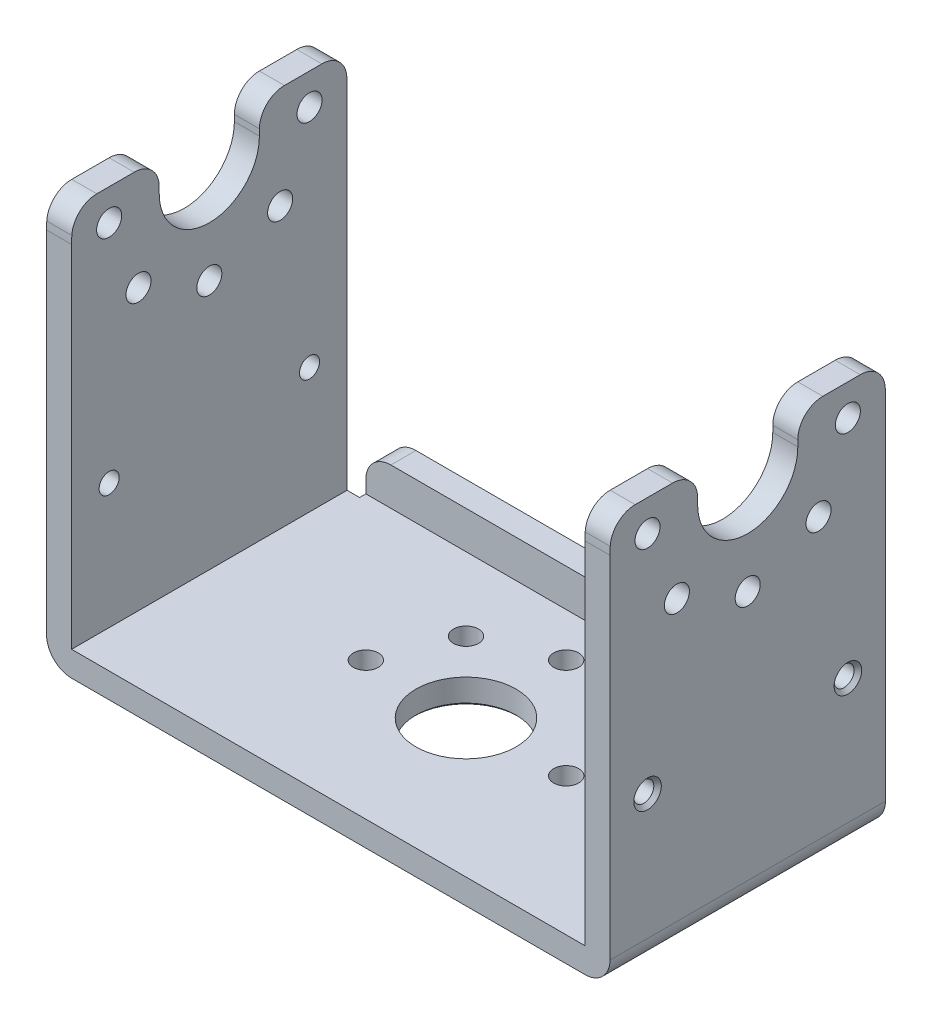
ISO-10303-21;
HEADER;
FILE_DESCRIPTION(('STEP AP214'),'2;1');
FILE_NAME('part.step','',(''),(''),'','','');
FILE_SCHEMA(('AUTOMOTIVE_DESIGN { 1 0 10303 214 1 1 1 1 }'));
ENDSEC;
DATA;
#1=APPLICATION_CONTEXT('core data for automotive mechanical design processes');
#2=APPLICATION_PROTOCOL_DEFINITION('international standard','automotive_design',2000,#1);
#3=PRODUCT_CONTEXT('',#1,'mechanical');
#4=PRODUCT('Part','Part','',(#3));
#5=PRODUCT_RELATED_PRODUCT_CATEGORY('part','',(#4));
#6=PRODUCT_DEFINITION_FORMATION('','',#4);
#7=PRODUCT_DEFINITION_CONTEXT('part definition',#1,'design');
#8=PRODUCT_DEFINITION('design','',#6,#7);
#9=PRODUCT_DEFINITION_SHAPE('','',#8);
#10=(LENGTH_UNIT() NAMED_UNIT(*) SI_UNIT(.MILLI.,.METRE.));
#11=(NAMED_UNIT(*) PLANE_ANGLE_UNIT() SI_UNIT($,.RADIAN.));
#12=(NAMED_UNIT(*) SI_UNIT($,.STERADIAN.) SOLID_ANGLE_UNIT());
#13=UNCERTAINTY_MEASURE_WITH_UNIT(LENGTH_MEASURE(1.E-05),#10,'distance_accuracy_value','');
#14=(GEOMETRIC_REPRESENTATION_CONTEXT(3) GLOBAL_UNCERTAINTY_ASSIGNED_CONTEXT((#13)) GLOBAL_UNIT_ASSIGNED_CONTEXT((#10,
#11,#12)) REPRESENTATION_CONTEXT('',''));
#15=CARTESIAN_POINT('',(0.,0.,0.));
#16=DIRECTION('',(0.,0.,1.));
#17=DIRECTION('',(1.,0.,0.));
#18=AXIS2_PLACEMENT_3D('',#15,#16,#17);
#19=CARTESIAN_POINT('',(-22.7,120.7,4.99999999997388));
#20=DIRECTION('',(1.,0.,0.));
#21=DIRECTION('',(0.,0.,-1.));
#22=AXIS2_PLACEMENT_3D('',#19,#20,#21);
#23=CYLINDRICAL_SURFACE('',#22,10.9999999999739);
#24=DIRECTION('',(-1.,0.,0.));
#25=VECTOR('',#24,1.);
#26=CARTESIAN_POINT('',(-20.5,120.7,-6.));
#27=LINE('',#26,#25);
#28=CARTESIAN_POINT('',(-22.5,120.7,-6.));
#29=VERTEX_POINT('',#28);
#30=CARTESIAN_POINT('',(-20.5,120.7,-6.));
#31=VERTEX_POINT('',#30);
#32=EDGE_CURVE('E271',#29,#31,#27,.F.);
#33=ORIENTED_EDGE('',*,*,#32,.F.);
#34=CARTESIAN_POINT('',(-22.5,120.7,4.99999999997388));
#35=DIRECTION('',(1.,0.,0.));
#36=DIRECTION('',(0.,0.,-1.));
#37=AXIS2_PLACEMENT_3D('',#34,#35,#36);
#38=CIRCLE('',#37,10.9999999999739);
#39=CARTESIAN_POINT('',(-22.5,121.311111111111,-5.98301157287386));
#40=VERTEX_POINT('',#39);
#41=EDGE_CURVE('E276',#29,#40,#38,.T.);
#42=ORIENTED_EDGE('',*,*,#41,.T.);
#43=DIRECTION('',(1.,0.,0.));
#44=VECTOR('',#43,1.);
#45=CARTESIAN_POINT('',(-22.7,121.311111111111,-5.98301157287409));
#46=LINE('',#45,#44);
#47=CARTESIAN_POINT('',(-20.5,121.311111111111,-5.98301157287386));
#48=VERTEX_POINT('',#47);
#49=EDGE_CURVE('E274',#48,#40,#46,.F.);
#50=ORIENTED_EDGE('',*,*,#49,.F.);
#51=CARTESIAN_POINT('',(-20.5,120.7,4.99999999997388));
#52=DIRECTION('',(1.,0.,0.));
#53=DIRECTION('',(0.,0.,-1.));
#54=AXIS2_PLACEMENT_3D('',#51,#52,#53);
#55=CIRCLE('',#54,10.9999999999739);
#56=EDGE_CURVE('E21',#48,#31,#55,.F.);
#57=ORIENTED_EDGE('',*,*,#56,.T.);
#58=EDGE_LOOP('',(#33,#42,#50,#57));
#59=FACE_BOUND('',#58,.T.);
#60=ADVANCED_FACE('F17',(#59),#23,.T.);
#61=CARTESIAN_POINT('',(-20.5,120.7,1.));
#62=DIRECTION('',(0.,0.,1.));
#63=DIRECTION('',(1.,0.,0.));
#64=AXIS2_PLACEMENT_3D('',#61,#62,#63);
#65=PLANE('',#64);
#66=DIRECTION('',(0.,1.,0.));
#67=VECTOR('',#66,1.);
#68=CARTESIAN_POINT('',(-22.5,120.7,1.));
#69=LINE('',#68,#67);
#70=CARTESIAN_POINT('',(-22.5,121.2,0.999999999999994));
#71=VERTEX_POINT('',#70);
#72=CARTESIAN_POINT('',(-22.5,120.7,0.999999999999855));
#73=VERTEX_POINT('',#72);
#74=EDGE_CURVE('E525',#71,#73,#69,.F.);
#75=ORIENTED_EDGE('',*,*,#74,.T.);
#76=DIRECTION('',(1.,0.,0.));
#77=VECTOR('',#76,1.);
#78=CARTESIAN_POINT('',(-22.7,120.7,0.99999999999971));
#79=LINE('',#78,#77);
#80=CARTESIAN_POINT('',(-20.5,120.7,0.999999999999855));
#81=VERTEX_POINT('',#80);
#82=EDGE_CURVE('E442',#73,#81,#79,.T.);
#83=ORIENTED_EDGE('',*,*,#82,.T.);
#84=DIRECTION('',(0.,1.,0.));
#85=VECTOR('',#84,1.);
#86=CARTESIAN_POINT('',(-20.5,120.7,1.));
#87=LINE('',#86,#85);
#88=CARTESIAN_POINT('',(-20.5,121.2,0.999999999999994));
#89=VERTEX_POINT('',#88);
#90=EDGE_CURVE('E527',#81,#89,#87,.T.);
#91=ORIENTED_EDGE('',*,*,#90,.T.);
#92=DIRECTION('',(1.,0.,0.));
#93=VECTOR('',#92,1.);
#94=CARTESIAN_POINT('',(-22.7,121.2,0.999999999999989));
#95=LINE('',#94,#93);
#96=EDGE_CURVE('E450',#71,#89,#95,.T.);
#97=ORIENTED_EDGE('',*,*,#96,.F.);
#98=EDGE_LOOP('',(#75,#83,#91,#97));
#99=FACE_BOUND('',#98,.T.);
#100=ADVANCED_FACE('F1252',(#99),#65,.T.);
#101=CARTESIAN_POINT('',(-20.5,120.7,9.));
#102=DIRECTION('',(0.,0.,-1.));
#103=DIRECTION('',(-1.,0.,0.));
#104=AXIS2_PLACEMENT_3D('',#101,#102,#103);
#105=PLANE('',#104);
#106=DIRECTION('',(1.,0.,0.));
#107=VECTOR('',#106,1.);
#108=CARTESIAN_POINT('',(-22.7,121.2,9.00000000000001));
#109=LINE('',#108,#107);
#110=CARTESIAN_POINT('',(-20.500000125,121.2,9.00000000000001));
#111=VERTEX_POINT('',#110);
#112=CARTESIAN_POINT('',(-22.5,121.2,9.00000000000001));
#113=VERTEX_POINT('',#112);
#114=EDGE_CURVE('E468',#111,#113,#109,.F.);
#115=ORIENTED_EDGE('',*,*,#114,.F.);
#116=DIRECTION('',(0.,1.,0.));
#117=VECTOR('',#116,1.);
#118=CARTESIAN_POINT('',(-20.5,120.7,9.));
#119=LINE('',#118,#117);
#120=CARTESIAN_POINT('',(-20.5,120.700000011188,9.00000000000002));
#121=VERTEX_POINT('',#120);
#122=EDGE_CURVE('E504',#111,#121,#119,.F.);
#123=ORIENTED_EDGE('',*,*,#122,.T.);
#124=DIRECTION('',(1.,0.,0.));
#125=VECTOR('',#124,1.);
#126=CARTESIAN_POINT('',(-22.7,120.700000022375,9.00000000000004));
#127=LINE('',#126,#125);
#128=CARTESIAN_POINT('',(-22.5,120.700000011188,9.00000000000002));
#129=VERTEX_POINT('',#128);
#130=EDGE_CURVE('E445',#121,#129,#127,.F.);
#131=ORIENTED_EDGE('',*,*,#130,.T.);
#132=DIRECTION('',(0.,1.,0.));
#133=VECTOR('',#132,1.);
#134=CARTESIAN_POINT('',(-22.5,120.7,9.));
#135=LINE('',#134,#133);
#136=EDGE_CURVE('E523',#129,#113,#135,.T.);
#137=ORIENTED_EDGE('',*,*,#136,.T.);
#138=EDGE_LOOP('',(#115,#123,#131,#137));
#139=FACE_BOUND('',#138,.T.);
#140=ADVANCED_FACE('F1245',(#139),#105,.T.);
#141=CARTESIAN_POINT('',(-19.5,92.7,-6.50000000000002));
#142=DIRECTION('',(1.,0.,0.));
#143=DIRECTION('',(0.,0.,-1.));
#144=AXIS2_PLACEMENT_3D('',#141,#142,#143);
#145=CYLINDRICAL_SURFACE('',#144,1.99999999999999);
#146=CARTESIAN_POINT('',(19.5,92.7,-6.50000000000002));
#147=DIRECTION('',(1.,0.,0.));
#148=DIRECTION('',(0.,0.,-1.));
#149=AXIS2_PLACEMENT_3D('',#146,#147,#148);
#150=CIRCLE('',#149,1.99999999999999);
#151=CARTESIAN_POINT('',(19.5,90.7,-6.49999987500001));
#152=VERTEX_POINT('',#151);
#153=CARTESIAN_POINT('',(19.5,92.7,-8.5));
#154=VERTEX_POINT('',#153);
#155=EDGE_CURVE('E492',#152,#154,#150,.T.);
#156=ORIENTED_EDGE('',*,*,#155,.F.);
#157=DIRECTION('',(1.,0.,0.));
#158=VECTOR('',#157,1.);
#159=CARTESIAN_POINT('',(20.5,90.7,-6.49999975));
#160=LINE('',#159,#158);
#161=CARTESIAN_POINT('',(-19.5,90.7,-6.49999987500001));
#162=VERTEX_POINT('',#161);
#163=EDGE_CURVE('E507',#162,#152,#160,.T.);
#164=ORIENTED_EDGE('',*,*,#163,.F.);
#165=CARTESIAN_POINT('',(-19.5,92.7,-6.50000000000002));
#166=DIRECTION('',(1.,0.,0.));
#167=DIRECTION('',(0.,0.,-1.));
#168=AXIS2_PLACEMENT_3D('',#165,#166,#167);
#169=CIRCLE('',#168,1.99999999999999);
#170=CARTESIAN_POINT('',(-19.5,92.7,-8.5));
#171=VERTEX_POINT('',#170);
#172=EDGE_CURVE('E471',#171,#162,#169,.F.);
#173=ORIENTED_EDGE('',*,*,#172,.F.);
#174=DIRECTION('',(-1.,0.,0.));
#175=VECTOR('',#174,1.);
#176=CARTESIAN_POINT('',(-19.5,92.7,-8.5));
#177=LINE('',#176,#175);
#178=EDGE_CURVE('E531',#154,#171,#177,.T.);
#179=ORIENTED_EDGE('',*,*,#178,.F.);
#180=EDGE_LOOP('',(#156,#164,#173,#179));
#181=FACE_BOUND('',#180,.T.);
#182=ADVANCED_FACE('F826',(#181),#145,.T.);
#183=CARTESIAN_POINT('',(22.4999999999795,102.7,-3.));
#184=DIRECTION('',(1.,0.,0.));
#185=DIRECTION('',(0.,0.,-1.));
#186=AXIS2_PLACEMENT_3D('',#183,#184,#185);
#187=CONICAL_SURFACE('',#186,1.09999999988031,0.785398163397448);
#188=CARTESIAN_POINT('',(22.5000000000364,102.7,-3.));
#189=DIRECTION('',(1.,0.,0.));
#190=DIRECTION('',(0.,0.,-1.));
#191=AXIS2_PLACEMENT_3D('',#188,#189,#190);
#192=CIRCLE('',#191,1.09999999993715);
#193=CARTESIAN_POINT('',(22.5000000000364,102.7,-4.09999999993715));
#194=VERTEX_POINT('',#193);
#195=EDGE_CURVE('E677',#194,#194,#192,.F.);
#196=ORIENTED_EDGE('',*,*,#195,.F.);
#197=EDGE_LOOP('',(#196));
#198=FACE_BOUND('',#197,.T.);
#199=CARTESIAN_POINT('',(22.2,102.7,-3.));
#200=DIRECTION('',(1.,0.,0.));
#201=DIRECTION('',(0.,0.,-1.));
#202=AXIS2_PLACEMENT_3D('',#199,#200,#201);
#203=CIRCLE('',#202,0.800000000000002);
#204=CARTESIAN_POINT('',(22.2,102.7,-3.8));
#205=VERTEX_POINT('',#204);
#206=EDGE_CURVE('E673',#205,#205,#203,.F.);
#207=ORIENTED_EDGE('',*,*,#206,.T.);
#208=EDGE_LOOP('',(#207));
#209=FACE_BOUND('',#208,.T.);
#210=ADVANCED_FACE('F1230',(#198,#209),#187,.F.);
#211=CARTESIAN_POINT('',(22.4999999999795,102.7,13.));
#212=DIRECTION('',(1.,0.,0.));
#213=DIRECTION('',(0.,0.,-1.));
#214=AXIS2_PLACEMENT_3D('',#211,#212,#213);
#215=CONICAL_SURFACE('',#214,1.0999999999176,0.785398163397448);
#216=CARTESIAN_POINT('',(22.5000000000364,102.7,13.));
#217=DIRECTION('',(1.,0.,0.));
#218=DIRECTION('',(0.,0.,-1.));
#219=AXIS2_PLACEMENT_3D('',#216,#217,#218);
#220=CIRCLE('',#219,1.09999999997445);
#221=CARTESIAN_POINT('',(22.5000000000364,102.7,11.9000000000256));
#222=VERTEX_POINT('',#221);
#223=EDGE_CURVE('E680',#222,#222,#220,.F.);
#224=ORIENTED_EDGE('',*,*,#223,.F.);
#225=EDGE_LOOP('',(#224));
#226=FACE_BOUND('',#225,.T.);
#227=CARTESIAN_POINT('',(22.2,102.7,13.));
#228=DIRECTION('',(1.,0.,0.));
#229=DIRECTION('',(0.,0.,-1.));
#230=AXIS2_PLACEMENT_3D('',#227,#228,#229);
#231=CIRCLE('',#230,0.800000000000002);
#232=CARTESIAN_POINT('',(22.2,102.7,12.2));
#233=VERTEX_POINT('',#232);
#234=EDGE_CURVE('E670',#233,#233,#231,.F.);
#235=ORIENTED_EDGE('',*,*,#234,.T.);
#236=EDGE_LOOP('',(#235));
#237=FACE_BOUND('',#236,.T.);
#238=ADVANCED_FACE('F1222',(#226,#237),#215,.F.);
#239=CARTESIAN_POINT('',(20.5,120.7,9.));
#240=DIRECTION('',(0.,0.,-1.));
#241=DIRECTION('',(-1.,0.,0.));
#242=AXIS2_PLACEMENT_3D('',#239,#240,#241);
#243=PLANE('',#242);
#244=DIRECTION('',(0.,1.,0.));
#245=VECTOR('',#244,1.);
#246=CARTESIAN_POINT('',(22.5,123.2,9.00000000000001));
#247=LINE('',#246,#245);
#248=CARTESIAN_POINT('',(22.5,120.7,9.));
#249=VERTEX_POINT('',#248);
#250=CARTESIAN_POINT('',(22.499999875,121.2,9.00000000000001));
#251=VERTEX_POINT('',#250);
#252=EDGE_CURVE('E683',#249,#251,#247,.T.);
#253=ORIENTED_EDGE('',*,*,#252,.F.);
#254=DIRECTION('',(1.,0.,0.));
#255=VECTOR('',#254,1.);
#256=CARTESIAN_POINT('',(20.3,120.7,9.));
#257=LINE('',#256,#255);
#258=CARTESIAN_POINT('',(20.5,120.7,9.));
#259=VERTEX_POINT('',#258);
#260=EDGE_CURVE('E394',#249,#259,#257,.F.);
#261=ORIENTED_EDGE('',*,*,#260,.T.);
#262=DIRECTION('',(0.,1.,0.));
#263=VECTOR('',#262,1.);
#264=CARTESIAN_POINT('',(20.5,120.7,9.));
#265=LINE('',#264,#263);
#266=CARTESIAN_POINT('',(20.5,121.2,9.00000000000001));
#267=VERTEX_POINT('',#266);
#268=EDGE_CURVE('E502',#259,#267,#265,.T.);
#269=ORIENTED_EDGE('',*,*,#268,.T.);
#270=DIRECTION('',(-1.,0.,0.));
#271=VECTOR('',#270,1.);
#272=CARTESIAN_POINT('',(22.7,121.2,9.00000000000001));
#273=LINE('',#272,#271);
#274=EDGE_CURVE('E401',#251,#267,#273,.T.);
#275=ORIENTED_EDGE('',*,*,#274,.F.);
#276=EDGE_LOOP('',(#253,#261,#269,#275));
#277=FACE_BOUND('',#276,.T.);
#278=ADVANCED_FACE('F1214',(#277),#243,.T.);
#279=CARTESIAN_POINT('',(20.5,120.7,1.));
#280=DIRECTION('',(0.,0.,1.));
#281=DIRECTION('',(1.,0.,0.));
#282=AXIS2_PLACEMENT_3D('',#279,#280,#281);
#283=PLANE('',#282);
#284=DIRECTION('',(-1.,0.,0.));
#285=VECTOR('',#284,1.);
#286=CARTESIAN_POINT('',(22.7,121.2,0.99999999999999));
#287=LINE('',#286,#285);
#288=CARTESIAN_POINT('',(20.5,121.2,0.999999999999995));
#289=VERTEX_POINT('',#288);
#290=CARTESIAN_POINT('',(22.5,121.2,0.999999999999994));
#291=VERTEX_POINT('',#290);
#292=EDGE_CURVE('E390',#289,#291,#287,.F.);
#293=ORIENTED_EDGE('',*,*,#292,.F.);
#294=DIRECTION('',(0.,1.,0.));
#295=VECTOR('',#294,1.);
#296=CARTESIAN_POINT('',(20.5,120.7,1.));
#297=LINE('',#296,#295);
#298=CARTESIAN_POINT('',(20.5,120.7,1.));
#299=VERTEX_POINT('',#298);
#300=EDGE_CURVE('E500',#289,#299,#297,.F.);
#301=ORIENTED_EDGE('',*,*,#300,.T.);
#302=DIRECTION('',(1.,0.,0.));
#303=VECTOR('',#302,1.);
#304=CARTESIAN_POINT('',(20.3,120.7,1.));
#305=LINE('',#304,#303);
#306=CARTESIAN_POINT('',(22.5,120.7,1.));
#307=VERTEX_POINT('',#306);
#308=EDGE_CURVE('E397',#299,#307,#305,.T.);
#309=ORIENTED_EDGE('',*,*,#308,.T.);
#310=DIRECTION('',(0.,1.,0.));
#311=VECTOR('',#310,1.);
#312=CARTESIAN_POINT('',(22.5,123.2,0.999999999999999));
#313=LINE('',#312,#311);
#314=EDGE_CURVE('E685',#291,#307,#313,.F.);
#315=ORIENTED_EDGE('',*,*,#314,.F.);
#316=EDGE_LOOP('',(#293,#301,#309,#315));
#317=FACE_BOUND('',#316,.T.);
#318=ADVANCED_FACE('F1206',(#317),#283,.T.);
#319=CARTESIAN_POINT('',(20.2999999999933,120.7,4.99999999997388));
#320=DIRECTION('',(1.,0.,6.12278155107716E-13));
#321=DIRECTION('',(6.12278155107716E-13,0.,-1.));
#322=AXIS2_PLACEMENT_3D('',#319,#320,#321);
#323=CYLINDRICAL_SURFACE('',#322,10.9999999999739);
#324=DIRECTION('',(-1.,0.,0.));
#325=VECTOR('',#324,1.);
#326=CARTESIAN_POINT('',(22.7,121.311111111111,-5.98301157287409));
#327=LINE('',#326,#325);
#328=CARTESIAN_POINT('',(22.5000000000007,121.311111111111,-5.98301157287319));
#329=VERTEX_POINT('',#328);
#330=CARTESIAN_POINT('',(20.5000000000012,121.311111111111,-5.9830115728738));
#331=VERTEX_POINT('',#330);
#332=EDGE_CURVE('E378',#329,#331,#327,.T.);
#333=ORIENTED_EDGE('',*,*,#332,.F.);
#334=CARTESIAN_POINT('',(22.4999999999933,120.7,4.99999999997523));
#335=DIRECTION('',(1.,0.,6.12278155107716E-13));
#336=DIRECTION('',(6.12278155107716E-13,0.,-1.));
#337=AXIS2_PLACEMENT_3D('',#334,#335,#336);
#338=CIRCLE('',#337,10.9999999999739);
#339=CARTESIAN_POINT('',(22.5,120.7,-6.));
#340=VERTEX_POINT('',#339);
#341=EDGE_CURVE('E417',#340,#329,#338,.T.);
#342=ORIENTED_EDGE('',*,*,#341,.F.);
#343=DIRECTION('',(-1.,0.,0.));
#344=VECTOR('',#343,1.);
#345=CARTESIAN_POINT('',(20.5,120.7,-6.));
#346=LINE('',#345,#344);
#347=CARTESIAN_POINT('',(20.5,120.7,-6.));
#348=VERTEX_POINT('',#347);
#349=EDGE_CURVE('E385',#348,#340,#346,.F.);
#350=ORIENTED_EDGE('',*,*,#349,.F.);
#351=CARTESIAN_POINT('',(20.4999999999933,120.7,4.999999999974));
#352=DIRECTION('',(1.,0.,6.12278155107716E-13));
#353=DIRECTION('',(6.12278155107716E-13,0.,-1.));
#354=AXIS2_PLACEMENT_3D('',#351,#352,#353);
#355=CIRCLE('',#354,10.9999999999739);
#356=EDGE_CURVE('E484',#348,#331,#355,.T.);
#357=ORIENTED_EDGE('',*,*,#356,.T.);
#358=EDGE_LOOP('',(#333,#342,#350,#357));
#359=FACE_BOUND('',#358,.T.);
#360=ADVANCED_FACE('F1199',(#359),#323,.T.);
#361=CARTESIAN_POINT('',(19.5,93.7,-6.5));
#362=DIRECTION('',(1.,0.,0.));
#363=DIRECTION('',(0.,0.,-1.));
#364=AXIS2_PLACEMENT_3D('',#361,#362,#363);
#365=PLANE('',#364);
#366=DIRECTION('',(0.,1.,0.));
#367=VECTOR('',#366,1.);
#368=CARTESIAN_POINT('',(19.5,92.7,-8.5));
#369=LINE('',#368,#367);
#370=CARTESIAN_POINT('',(19.5,93.7,-8.5));
#371=VERTEX_POINT('',#370);
#372=EDGE_CURVE('E534',#371,#154,#369,.F.);
#373=ORIENTED_EDGE('',*,*,#372,.F.);
#374=DIRECTION('',(0.,0.,1.));
#375=VECTOR('',#374,1.);
#376=CARTESIAN_POINT('',(19.5,93.7,-8.7));
#377=LINE('',#376,#375);
#378=CARTESIAN_POINT('',(19.5,93.7,-6.5));
#379=VERTEX_POINT('',#378);
#380=EDGE_CURVE('E358',#379,#371,#377,.F.);
#381=ORIENTED_EDGE('',*,*,#380,.F.);
#382=DIRECTION('',(0.,1.,0.));
#383=VECTOR('',#382,1.);
#384=CARTESIAN_POINT('',(19.5,93.7,-6.5));
#385=LINE('',#384,#383);
#386=CARTESIAN_POINT('',(19.5,92.7,-6.5));
#387=VERTEX_POINT('',#386);
#388=EDGE_CURVE('E480',#379,#387,#385,.F.);
#389=ORIENTED_EDGE('',*,*,#388,.T.);
#390=DIRECTION('',(0.,0.,-1.));
#391=VECTOR('',#390,1.);
#392=CARTESIAN_POINT('',(19.5,92.7,-6.5));
#393=LINE('',#392,#391);
#394=CARTESIAN_POINT('',(19.5,92.7,-6.));
#395=VERTEX_POINT('',#394);
#396=EDGE_CURVE('E483',#387,#395,#393,.F.);
#397=ORIENTED_EDGE('',*,*,#396,.T.);
#398=DIRECTION('',(0.,1.,0.));
#399=VECTOR('',#398,1.);
#400=CARTESIAN_POINT('',(19.5,120.7,-6.));
#401=LINE('',#400,#399);
#402=CARTESIAN_POINT('',(19.5,90.7,-6.));
#403=VERTEX_POINT('',#402);
#404=EDGE_CURVE('E375',#403,#395,#401,.T.);
#405=ORIENTED_EDGE('',*,*,#404,.F.);
#406=DIRECTION('',(0.,0.,-1.));
#407=VECTOR('',#406,1.);
#408=CARTESIAN_POINT('',(19.5,90.7,-6.5));
#409=LINE('',#408,#407);
#410=EDGE_CURVE('E425',#152,#403,#409,.F.);
#411=ORIENTED_EDGE('',*,*,#410,.F.);
#412=ORIENTED_EDGE('',*,*,#155,.T.);
#413=EDGE_LOOP('',(#373,#381,#389,#397,#405,#411,#412));
#414=FACE_BOUND('',#413,.T.);
#415=ADVANCED_FACE('F831',(#414),#365,.T.);
#416=CARTESIAN_POINT('',(-19.5,92.7,-8.5));
#417=DIRECTION('',(0.,0.,-1.));
#418=DIRECTION('',(-1.,0.,0.));
#419=AXIS2_PLACEMENT_3D('',#416,#417,#418);
#420=PLANE('',#419);
#421=CARTESIAN_POINT('',(-17.5,93.7,-8.5));
#422=DIRECTION('',(0.,0.,1.));
#423=DIRECTION('',(1.,0.,0.));
#424=AXIS2_PLACEMENT_3D('',#421,#422,#423);
#425=CIRCLE('',#424,2.00000000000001);
#426=CARTESIAN_POINT('',(-17.5,95.7,-8.5));
#427=VERTEX_POINT('',#426);
#428=CARTESIAN_POINT('',(-19.5,93.7,-8.5));
#429=VERTEX_POINT('',#428);
#430=EDGE_CURVE('E350',#427,#429,#425,.T.);
#431=ORIENTED_EDGE('',*,*,#430,.F.);
#432=DIRECTION('',(1.,0.,0.));
#433=VECTOR('',#432,1.);
#434=CARTESIAN_POINT('',(-17.5,95.7,-8.5));
#435=LINE('',#434,#433);
#436=CARTESIAN_POINT('',(17.5,95.7,-8.5));
#437=VERTEX_POINT('',#436);
#438=EDGE_CURVE('E357',#437,#427,#435,.F.);
#439=ORIENTED_EDGE('',*,*,#438,.F.);
#440=CARTESIAN_POINT('',(17.5,93.7,-8.5));
#441=DIRECTION('',(0.,0.,1.));
#442=DIRECTION('',(1.,0.,0.));
#443=AXIS2_PLACEMENT_3D('',#440,#441,#442);
#444=CIRCLE('',#443,2.00000000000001);
#445=EDGE_CURVE('E361',#371,#437,#444,.T.);
#446=ORIENTED_EDGE('',*,*,#445,.F.);
#447=ORIENTED_EDGE('',*,*,#372,.T.);
#448=ORIENTED_EDGE('',*,*,#178,.T.);
#449=DIRECTION('',(0.,1.,0.));
#450=VECTOR('',#449,1.);
#451=CARTESIAN_POINT('',(-19.5,90.7,-8.5));
#452=LINE('',#451,#450);
#453=EDGE_CURVE('E476',#429,#171,#452,.F.);
#454=ORIENTED_EDGE('',*,*,#453,.F.);
#455=EDGE_LOOP('',(#431,#439,#446,#447,#448,#454));
#456=FACE_BOUND('',#455,.T.);
#457=ADVANCED_FACE('F855',(#456),#420,.T.);
#458=CARTESIAN_POINT('',(-19.5,90.7,-6.));
#459=DIRECTION('',(-1.,0.,0.));
#460=DIRECTION('',(0.,0.,1.));
#461=AXIS2_PLACEMENT_3D('',#458,#459,#460);
#462=PLANE('',#461);
#463=ORIENTED_EDGE('',*,*,#172,.T.);
#464=DIRECTION('',(0.,0.,-1.));
#465=VECTOR('',#464,1.);
#466=CARTESIAN_POINT('',(-19.5,90.7,-6.5));
#467=LINE('',#466,#465);
#468=CARTESIAN_POINT('',(-19.5,90.7,-6.));
#469=VERTEX_POINT('',#468);
#470=EDGE_CURVE('E510',#469,#162,#467,.T.);
#471=ORIENTED_EDGE('',*,*,#470,.F.);
#472=DIRECTION('',(0.,1.,0.));
#473=VECTOR('',#472,1.);
#474=CARTESIAN_POINT('',(-19.5,92.7,-6.));
#475=LINE('',#474,#473);
#476=CARTESIAN_POINT('',(-19.5,92.7,-6.));
#477=VERTEX_POINT('',#476);
#478=EDGE_CURVE('E285',#477,#469,#475,.F.);
#479=ORIENTED_EDGE('',*,*,#478,.F.);
#480=DIRECTION('',(0.,0.,1.));
#481=VECTOR('',#480,1.);
#482=CARTESIAN_POINT('',(-19.5,92.7,-6.));
#483=LINE('',#482,#481);
#484=CARTESIAN_POINT('',(-19.5,92.7,-6.5));
#485=VERTEX_POINT('',#484);
#486=EDGE_CURVE('E477',#477,#485,#483,.F.);
#487=ORIENTED_EDGE('',*,*,#486,.T.);
#488=DIRECTION('',(0.,1.,0.));
#489=VECTOR('',#488,1.);
#490=CARTESIAN_POINT('',(-19.5,90.7,-6.5));
#491=LINE('',#490,#489);
#492=CARTESIAN_POINT('',(-19.5,93.7,-6.5));
#493=VERTEX_POINT('',#492);
#494=EDGE_CURVE('E474',#485,#493,#491,.T.);
#495=ORIENTED_EDGE('',*,*,#494,.T.);
#496=DIRECTION('',(0.,0.,1.));
#497=VECTOR('',#496,1.);
#498=CARTESIAN_POINT('',(-19.5,93.7,-8.7));
#499=LINE('',#498,#497);
#500=EDGE_CURVE('E346',#429,#493,#499,.T.);
#501=ORIENTED_EDGE('',*,*,#500,.F.);
#502=ORIENTED_EDGE('',*,*,#453,.T.);
#503=EDGE_LOOP('',(#463,#471,#479,#487,#495,#501,#502));
#504=FACE_BOUND('',#503,.T.);
#505=ADVANCED_FACE('F820',(#504),#462,.T.);
#506=CARTESIAN_POINT('',(0.,90.7000000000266,5.));
#507=DIRECTION('',(0.,-1.,0.));
#508=DIRECTION('',(0.,0.,-1.));
#509=AXIS2_PLACEMENT_3D('',#506,#507,#508);
#510=CONICAL_SURFACE('',#509,4.20000000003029,0.785398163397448);
#511=CARTESIAN_POINT('',(0.,90.7000000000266,5.));
#512=DIRECTION('',(0.,-1.,0.));
#513=DIRECTION('',(0.,0.,-1.));
#514=AXIS2_PLACEMENT_3D('',#511,#512,#513);
#515=CIRCLE('',#514,4.20000000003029);
#516=CARTESIAN_POINT('',(0.,90.7000000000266,0.799999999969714));
#517=VERTEX_POINT('',#516);
#518=EDGE_CURVE('E420',#517,#517,#515,.F.);
#519=ORIENTED_EDGE('',*,*,#518,.F.);
#520=EDGE_LOOP('',(#519));
#521=FACE_BOUND('',#520,.T.);
#522=CARTESIAN_POINT('',(0.,90.9,5.));
#523=DIRECTION('',(0.,-1.,0.));
#524=DIRECTION('',(0.,0.,-1.));
#525=AXIS2_PLACEMENT_3D('',#522,#523,#524);
#526=CIRCLE('',#525,4.);
#527=CARTESIAN_POINT('',(0.,90.9,1.));
#528=VERTEX_POINT('',#527);
#529=EDGE_CURVE('E623',#528,#528,#526,.F.);
#530=ORIENTED_EDGE('',*,*,#529,.T.);
#531=EDGE_LOOP('',(#530));
#532=FACE_BOUND('',#531,.T.);
#533=ADVANCED_FACE('F768',(#521,#532),#510,.F.);
#534=CARTESIAN_POINT('',(-22.7,102.7,-3.));
#535=DIRECTION('',(1.,0.,0.));
#536=DIRECTION('',(0.,0.,-1.));
#537=AXIS2_PLACEMENT_3D('',#534,#535,#536);
#538=CYLINDRICAL_SURFACE('',#537,0.800000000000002);
#539=CARTESIAN_POINT('',(-20.5,102.7,-3.));
#540=DIRECTION('',(1.,0.,0.));
#541=DIRECTION('',(0.,0.,-1.));
#542=AXIS2_PLACEMENT_3D('',#539,#540,#541);
#543=CIRCLE('',#542,0.800000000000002);
#544=CARTESIAN_POINT('',(-20.5,102.7,-3.8));
#545=VERTEX_POINT('',#544);
#546=EDGE_CURVE('E620',#545,#545,#543,.F.);
#547=ORIENTED_EDGE('',*,*,#546,.F.);
#548=EDGE_LOOP('',(#547));
#549=FACE_BOUND('',#548,.T.);
#550=CARTESIAN_POINT('',(-22.5,102.7,-3.));
#551=DIRECTION('',(1.,0.,0.));
#552=DIRECTION('',(0.,0.,-1.));
#553=AXIS2_PLACEMENT_3D('',#550,#551,#552);
#554=CIRCLE('',#553,0.800000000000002);
#555=CARTESIAN_POINT('',(-22.5,102.7,-3.8));
#556=VERTEX_POINT('',#555);
#557=EDGE_CURVE('E689',#556,#556,#554,.T.);
#558=ORIENTED_EDGE('',*,*,#557,.F.);
#559=EDGE_LOOP('',(#558));
#560=FACE_BOUND('',#559,.T.);
#561=ADVANCED_FACE('F1165',(#549,#560),#538,.F.);
#562=CARTESIAN_POINT('',(-22.7,102.7,13.));
#563=DIRECTION('',(1.,0.,0.));
#564=DIRECTION('',(0.,0.,-1.));
#565=AXIS2_PLACEMENT_3D('',#562,#563,#564);
#566=CYLINDRICAL_SURFACE('',#565,0.800000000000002);
#567=CARTESIAN_POINT('',(-20.5,102.7,13.));
#568=DIRECTION('',(1.,0.,0.));
#569=DIRECTION('',(0.,0.,-1.));
#570=AXIS2_PLACEMENT_3D('',#567,#568,#569);
#571=CIRCLE('',#570,0.800000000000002);
#572=CARTESIAN_POINT('',(-20.5,102.7,12.2));
#573=VERTEX_POINT('',#572);
#574=EDGE_CURVE('E617',#573,#573,#571,.F.);
#575=ORIENTED_EDGE('',*,*,#574,.F.);
#576=EDGE_LOOP('',(#575));
#577=FACE_BOUND('',#576,.T.);
#578=CARTESIAN_POINT('',(-22.5,102.7,13.));
#579=DIRECTION('',(1.,0.,0.));
#580=DIRECTION('',(0.,0.,-1.));
#581=AXIS2_PLACEMENT_3D('',#578,#579,#580);
#582=CIRCLE('',#581,0.800000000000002);
#583=CARTESIAN_POINT('',(-22.5,102.7,12.2));
#584=VERTEX_POINT('',#583);
#585=EDGE_CURVE('E692',#584,#584,#582,.T.);
#586=ORIENTED_EDGE('',*,*,#585,.F.);
#587=EDGE_LOOP('',(#586));
#588=FACE_BOUND('',#587,.T.);
#589=ADVANCED_FACE('F1157',(#577,#588),#566,.F.);
#590=CARTESIAN_POINT('',(-20.3,120.7,13.));
#591=DIRECTION('',(-1.,0.,0.));
#592=DIRECTION('',(0.,0.,1.));
#593=AXIS2_PLACEMENT_3D('',#590,#591,#592);
#594=CYLINDRICAL_SURFACE('',#593,1.);
#595=CARTESIAN_POINT('',(-20.5,120.7,13.));
#596=DIRECTION('',(-1.,0.,0.));
#597=DIRECTION('',(0.,0.,1.));
#598=AXIS2_PLACEMENT_3D('',#595,#596,#597);
#599=CIRCLE('',#598,1.);
#600=CARTESIAN_POINT('',(-20.5,120.7,14.));
#601=VERTEX_POINT('',#600);
#602=EDGE_CURVE('E614',#601,#601,#599,.T.);
#603=ORIENTED_EDGE('',*,*,#602,.F.);
#604=EDGE_LOOP('',(#603));
#605=FACE_BOUND('',#604,.T.);
#606=CARTESIAN_POINT('',(-22.5,120.7,13.));
#607=DIRECTION('',(-1.,0.,0.));
#608=DIRECTION('',(0.,0.,1.));
#609=AXIS2_PLACEMENT_3D('',#606,#607,#608);
#610=CIRCLE('',#609,1.);
#611=CARTESIAN_POINT('',(-22.5,120.7,14.));
#612=VERTEX_POINT('',#611);
#613=EDGE_CURVE('E695',#612,#612,#610,.F.);
#614=ORIENTED_EDGE('',*,*,#613,.F.);
#615=EDGE_LOOP('',(#614));
#616=FACE_BOUND('',#615,.T.);
#617=ADVANCED_FACE('F1149',(#605,#616),#594,.F.);
#618=CARTESIAN_POINT('',(-20.3,115.043145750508,10.656854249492));
#619=DIRECTION('',(-1.,0.,0.));
#620=DIRECTION('',(0.,0.,1.));
#621=AXIS2_PLACEMENT_3D('',#618,#619,#620);
#622=CYLINDRICAL_SURFACE('',#621,1.);
#623=CARTESIAN_POINT('',(-20.5,115.043145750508,10.656854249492));
#624=DIRECTION('',(-1.,0.,0.));
#625=DIRECTION('',(0.,0.,1.));
#626=AXIS2_PLACEMENT_3D('',#623,#624,#625);
#627=CIRCLE('',#626,1.);
#628=CARTESIAN_POINT('',(-20.5,115.043145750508,11.656854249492));
#629=VERTEX_POINT('',#628);
#630=EDGE_CURVE('E611',#629,#629,#627,.T.);
#631=ORIENTED_EDGE('',*,*,#630,.F.);
#632=EDGE_LOOP('',(#631));
#633=FACE_BOUND('',#632,.T.);
#634=CARTESIAN_POINT('',(-22.5,115.043145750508,10.656854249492));
#635=DIRECTION('',(-1.,0.,0.));
#636=DIRECTION('',(0.,0.,1.));
#637=AXIS2_PLACEMENT_3D('',#634,#635,#636);
#638=CIRCLE('',#637,1.);
#639=CARTESIAN_POINT('',(-22.5,115.043145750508,11.656854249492));
#640=VERTEX_POINT('',#639);
#641=EDGE_CURVE('E698',#640,#640,#638,.F.);
#642=ORIENTED_EDGE('',*,*,#641,.F.);
#643=EDGE_LOOP('',(#642));
#644=FACE_BOUND('',#643,.T.);
#645=ADVANCED_FACE('F1141',(#633,#644),#622,.F.);
#646=CARTESIAN_POINT('',(-20.3,112.7,5.));
#647=DIRECTION('',(-1.,0.,0.));
#648=DIRECTION('',(0.,0.,1.));
#649=AXIS2_PLACEMENT_3D('',#646,#647,#648);
#650=CYLINDRICAL_SURFACE('',#649,1.);
#651=CARTESIAN_POINT('',(-20.5,112.7,5.));
#652=DIRECTION('',(-1.,0.,0.));
#653=DIRECTION('',(0.,0.,1.));
#654=AXIS2_PLACEMENT_3D('',#651,#652,#653);
#655=CIRCLE('',#654,1.);
#656=CARTESIAN_POINT('',(-20.5,112.7,6.));
#657=VERTEX_POINT('',#656);
#658=EDGE_CURVE('E608',#657,#657,#655,.T.);
#659=ORIENTED_EDGE('',*,*,#658,.F.);
#660=EDGE_LOOP('',(#659));
#661=FACE_BOUND('',#660,.T.);
#662=CARTESIAN_POINT('',(-22.5,112.7,5.));
#663=DIRECTION('',(-1.,0.,0.));
#664=DIRECTION('',(0.,0.,1.));
#665=AXIS2_PLACEMENT_3D('',#662,#663,#664);
#666=CIRCLE('',#665,1.);
#667=CARTESIAN_POINT('',(-22.5,112.7,6.));
#668=VERTEX_POINT('',#667);
#669=EDGE_CURVE('E701',#668,#668,#666,.F.);
#670=ORIENTED_EDGE('',*,*,#669,.F.);
#671=EDGE_LOOP('',(#670));
#672=FACE_BOUND('',#671,.T.);
#673=ADVANCED_FACE('F1133',(#661,#672),#650,.F.);
#674=CARTESIAN_POINT('',(-20.3,115.043145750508,-0.656854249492));
#675=DIRECTION('',(-1.,0.,0.));
#676=DIRECTION('',(0.,0.,1.));
#677=AXIS2_PLACEMENT_3D('',#674,#675,#676);
#678=CYLINDRICAL_SURFACE('',#677,1.);
#679=CARTESIAN_POINT('',(-20.5,115.043145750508,-0.656854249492));
#680=DIRECTION('',(-1.,0.,0.));
#681=DIRECTION('',(0.,0.,1.));
#682=AXIS2_PLACEMENT_3D('',#679,#680,#681);
#683=CIRCLE('',#682,1.);
#684=CARTESIAN_POINT('',(-20.5,115.043145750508,0.343145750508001));
#685=VERTEX_POINT('',#684);
#686=EDGE_CURVE('E605',#685,#685,#683,.T.);
#687=ORIENTED_EDGE('',*,*,#686,.F.);
#688=EDGE_LOOP('',(#687));
#689=FACE_BOUND('',#688,.T.);
#690=CARTESIAN_POINT('',(-22.5,115.043145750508,-0.656854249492));
#691=DIRECTION('',(-1.,0.,0.));
#692=DIRECTION('',(0.,0.,1.));
#693=AXIS2_PLACEMENT_3D('',#690,#691,#692);
#694=CIRCLE('',#693,1.);
#695=CARTESIAN_POINT('',(-22.5,115.043145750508,0.343145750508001));
#696=VERTEX_POINT('',#695);
#697=EDGE_CURVE('E704',#696,#696,#694,.F.);
#698=ORIENTED_EDGE('',*,*,#697,.F.);
#699=EDGE_LOOP('',(#698));
#700=FACE_BOUND('',#699,.T.);
#701=ADVANCED_FACE('F1125',(#689,#700),#678,.F.);
#702=CARTESIAN_POINT('',(-20.3,120.7,-3.));
#703=DIRECTION('',(-1.,0.,0.));
#704=DIRECTION('',(0.,0.,1.));
#705=AXIS2_PLACEMENT_3D('',#702,#703,#704);
#706=CYLINDRICAL_SURFACE('',#705,1.);
#707=CARTESIAN_POINT('',(-20.5,120.7,-3.));
#708=DIRECTION('',(-1.,0.,0.));
#709=DIRECTION('',(0.,0.,1.));
#710=AXIS2_PLACEMENT_3D('',#707,#708,#709);
#711=CIRCLE('',#710,1.);
#712=CARTESIAN_POINT('',(-20.5,120.7,-2.));
#713=VERTEX_POINT('',#712);
#714=EDGE_CURVE('E602',#713,#713,#711,.T.);
#715=ORIENTED_EDGE('',*,*,#714,.F.);
#716=EDGE_LOOP('',(#715));
#717=FACE_BOUND('',#716,.T.);
#718=CARTESIAN_POINT('',(-22.5,120.7,-3.));
#719=DIRECTION('',(-1.,0.,0.));
#720=DIRECTION('',(0.,0.,1.));
#721=AXIS2_PLACEMENT_3D('',#718,#719,#720);
#722=CIRCLE('',#721,1.);
#723=CARTESIAN_POINT('',(-22.5,120.7,-2.));
#724=VERTEX_POINT('',#723);
#725=EDGE_CURVE('E707',#724,#724,#722,.F.);
#726=ORIENTED_EDGE('',*,*,#725,.F.);
#727=EDGE_LOOP('',(#726));
#728=FACE_BOUND('',#727,.T.);
#729=ADVANCED_FACE('F1117',(#717,#728),#706,.F.);
#730=CARTESIAN_POINT('',(-22.7,121.2,11.));
#731=DIRECTION('',(1.,0.,0.));
#732=DIRECTION('',(0.,0.,-1.));
#733=AXIS2_PLACEMENT_3D('',#730,#731,#732);
#734=CYLINDRICAL_SURFACE('',#733,2.00000000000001);
#735=CARTESIAN_POINT('',(-20.50000025,121.2,11.));
#736=DIRECTION('',(1.,0.,0.));
#737=DIRECTION('',(0.,0.,-1.));
#738=AXIS2_PLACEMENT_3D('',#735,#736,#737);
#739=CIRCLE('',#738,2.00000000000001);
#740=CARTESIAN_POINT('',(-20.500000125,123.2,11.));
#741=VERTEX_POINT('',#740);
#742=EDGE_CURVE('E308',#111,#741,#739,.T.);
#743=ORIENTED_EDGE('',*,*,#742,.F.);
#744=ORIENTED_EDGE('',*,*,#114,.T.);
#745=CARTESIAN_POINT('',(-22.5,121.2,11.));
#746=DIRECTION('',(1.,0.,0.));
#747=DIRECTION('',(0.,0.,-1.));
#748=AXIS2_PLACEMENT_3D('',#745,#746,#747);
#749=CIRCLE('',#748,2.00000000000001);
#750=CARTESIAN_POINT('',(-22.5,123.2,11.));
#751=VERTEX_POINT('',#750);
#752=EDGE_CURVE('E723',#751,#113,#749,.F.);
#753=ORIENTED_EDGE('',*,*,#752,.F.);
#754=DIRECTION('',(1.,0.,0.));
#755=VECTOR('',#754,1.);
#756=CARTESIAN_POINT('',(-20.5,123.2,11.));
#757=LINE('',#756,#755);
#758=EDGE_CURVE('E466',#741,#751,#757,.F.);
#759=ORIENTED_EDGE('',*,*,#758,.F.);
#760=EDGE_LOOP('',(#743,#744,#753,#759));
#761=FACE_BOUND('',#760,.T.);
#762=ADVANCED_FACE('F1109',(#761),#734,.T.);
#763=CARTESIAN_POINT('',(-20.5,123.2,13.986100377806));
#764=DIRECTION('',(0.,1.,0.));
#765=DIRECTION('',(0.,0.,1.));
#766=AXIS2_PLACEMENT_3D('',#763,#764,#765);
#767=PLANE('',#766);
#768=DIRECTION('',(0.,0.,1.));
#769=VECTOR('',#768,1.);
#770=CARTESIAN_POINT('',(-22.5,123.2,-6.));
#771=LINE('',#770,#769);
#772=CARTESIAN_POINT('',(-22.499999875,123.2,13.986100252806));
#773=VERTEX_POINT('',#772);
#774=EDGE_CURVE('E726',#773,#751,#771,.F.);
#775=ORIENTED_EDGE('',*,*,#774,.F.);
#776=DIRECTION('',(1.,0.,0.));
#777=VECTOR('',#776,1.);
#778=CARTESIAN_POINT('',(-22.7,123.2,13.986100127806));
#779=LINE('',#778,#777);
#780=CARTESIAN_POINT('',(-20.5,123.2,13.986100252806));
#781=VERTEX_POINT('',#780);
#782=EDGE_CURVE('E459',#781,#773,#779,.F.);
#783=ORIENTED_EDGE('',*,*,#782,.F.);
#784=DIRECTION('',(0.,0.,-1.));
#785=VECTOR('',#784,1.);
#786=CARTESIAN_POINT('',(-20.5,123.2,-6.));
#787=LINE('',#786,#785);
#788=EDGE_CURVE('E305',#741,#781,#787,.F.);
#789=ORIENTED_EDGE('',*,*,#788,.F.);
#790=ORIENTED_EDGE('',*,*,#758,.T.);
#791=EDGE_LOOP('',(#775,#783,#789,#790));
#792=FACE_BOUND('',#791,.T.);
#793=ADVANCED_FACE('F1101',(#792),#767,.T.);
#794=CARTESIAN_POINT('',(-22.7,121.2,13.986100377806));
#795=DIRECTION('',(1.,0.,0.));
#796=DIRECTION('',(0.,0.,-1.));
#797=AXIS2_PLACEMENT_3D('',#794,#795,#796);
#798=CYLINDRICAL_SURFACE('',#797,2.00000000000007);
#799=CARTESIAN_POINT('',(-20.5,121.2,13.986100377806));
#800=DIRECTION('',(1.,0.,0.));
#801=DIRECTION('',(0.,0.,-1.));
#802=AXIS2_PLACEMENT_3D('',#799,#800,#801);
#803=CIRCLE('',#802,2.00000000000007);
#804=CARTESIAN_POINT('',(-20.5,121.311111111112,15.9830115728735));
#805=VERTEX_POINT('',#804);
#806=EDGE_CURVE('E298',#781,#805,#803,.T.);
#807=ORIENTED_EDGE('',*,*,#806,.F.);
#808=ORIENTED_EDGE('',*,*,#782,.T.);
#809=CARTESIAN_POINT('',(-22.49999975,121.2,13.986100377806));
#810=DIRECTION('',(1.,0.,0.));
#811=DIRECTION('',(0.,0.,-1.));
#812=AXIS2_PLACEMENT_3D('',#809,#810,#811);
#813=CIRCLE('',#812,2.00000000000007);
#814=CARTESIAN_POINT('',(-22.4999998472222,121.311111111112,15.9830115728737));
#815=VERTEX_POINT('',#814);
#816=EDGE_CURVE('E464',#815,#773,#813,.F.);
#817=ORIENTED_EDGE('',*,*,#816,.F.);
#818=DIRECTION('',(1.,0.,0.));
#819=VECTOR('',#818,1.);
#820=CARTESIAN_POINT('',(-22.7,121.311111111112,15.9830115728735));
#821=LINE('',#820,#819);
#822=EDGE_CURVE('E449',#805,#815,#821,.F.);
#823=ORIENTED_EDGE('',*,*,#822,.F.);
#824=EDGE_LOOP('',(#807,#808,#817,#823));
#825=FACE_BOUND('',#824,.T.);
#826=ADVANCED_FACE('F1094',(#825),#798,.T.);
#827=CARTESIAN_POINT('',(-20.5,92.7,-6.));
#828=DIRECTION('',(0.,0.,-1.));
#829=DIRECTION('',(-1.,0.,0.));
#830=AXIS2_PLACEMENT_3D('',#827,#828,#829);
#831=PLANE('',#830);
#832=DIRECTION('',(0.,1.,0.));
#833=VECTOR('',#832,1.);
#834=CARTESIAN_POINT('',(-22.5,92.7,-6.));
#835=LINE('',#834,#833);
#836=CARTESIAN_POINT('',(-22.5,92.7,-6.));
#837=VERTEX_POINT('',#836);
#838=EDGE_CURVE('E284',#29,#837,#835,.F.);
#839=ORIENTED_EDGE('',*,*,#838,.F.);
#840=ORIENTED_EDGE('',*,*,#32,.T.);
#841=DIRECTION('',(0.,1.,0.));
#842=VECTOR('',#841,1.);
#843=CARTESIAN_POINT('',(-20.5,92.7,-6.));
#844=LINE('',#843,#842);
#845=CARTESIAN_POINT('',(-20.5,92.7,-6.));
#846=VERTEX_POINT('',#845);
#847=EDGE_CURVE('E281',#846,#31,#844,.T.);
#848=ORIENTED_EDGE('',*,*,#847,.F.);
#849=DIRECTION('',(-1.,0.,0.));
#850=VECTOR('',#849,1.);
#851=CARTESIAN_POINT('',(-20.5,92.7,-6.));
#852=LINE('',#851,#850);
#853=EDGE_CURVE('E457',#846,#477,#852,.F.);
#854=ORIENTED_EDGE('',*,*,#853,.T.);
#855=ORIENTED_EDGE('',*,*,#478,.T.);
#856=DIRECTION('',(1.,0.,0.));
#857=VECTOR('',#856,1.);
#858=CARTESIAN_POINT('',(20.5,90.7,-6.));
#859=LINE('',#858,#857);
#860=CARTESIAN_POINT('',(-20.499999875,90.7,-6.));
#861=VERTEX_POINT('',#860);
#862=EDGE_CURVE('E424',#861,#469,#859,.T.);
#863=ORIENTED_EDGE('',*,*,#862,.F.);
#864=CARTESIAN_POINT('',(-20.5,92.7,-6.));
#865=DIRECTION('',(0.,0.,1.));
#866=DIRECTION('',(1.,0.,0.));
#867=AXIS2_PLACEMENT_3D('',#864,#865,#866);
#868=CIRCLE('',#867,1.99999999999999);
#869=EDGE_CURVE('E429',#837,#861,#868,.T.);
#870=ORIENTED_EDGE('',*,*,#869,.F.);
#871=EDGE_LOOP('',(#839,#840,#848,#854,#855,#863,#870));
#872=FACE_BOUND('',#871,.T.);
#873=ADVANCED_FACE('F279',(#872),#831,.T.);
#874=CARTESIAN_POINT('',(-22.7,121.2,-3.98610037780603));
#875=DIRECTION('',(1.,0.,0.));
#876=DIRECTION('',(0.,0.,-1.));
#877=AXIS2_PLACEMENT_3D('',#874,#875,#876);
#878=CYLINDRICAL_SURFACE('',#877,2.00000000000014);
#879=CARTESIAN_POINT('',(-20.5,121.2,-3.98610037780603));
#880=DIRECTION('',(1.,0.,0.));
#881=DIRECTION('',(0.,0.,-1.));
#882=AXIS2_PLACEMENT_3D('',#879,#880,#881);
#883=CIRCLE('',#882,2.00000000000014);
#884=CARTESIAN_POINT('',(-20.5,123.2,-3.98610037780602));
#885=VERTEX_POINT('',#884);
#886=EDGE_CURVE('E293',#48,#885,#883,.T.);
#887=ORIENTED_EDGE('',*,*,#886,.F.);
#888=ORIENTED_EDGE('',*,*,#49,.T.);
#889=CARTESIAN_POINT('',(-22.5,121.2,-3.98610037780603));
#890=DIRECTION('',(1.,0.,0.));
#891=DIRECTION('',(0.,0.,-1.));
#892=AXIS2_PLACEMENT_3D('',#889,#890,#891);
#893=CIRCLE('',#892,2.00000000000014);
#894=CARTESIAN_POINT('',(-22.5,123.2,-3.98610037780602));
#895=VERTEX_POINT('',#894);
#896=EDGE_CURVE('E713',#895,#40,#893,.F.);
#897=ORIENTED_EDGE('',*,*,#896,.F.);
#898=DIRECTION('',(1.,0.,0.));
#899=VECTOR('',#898,1.);
#900=CARTESIAN_POINT('',(-20.5,123.2,-3.98610037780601));
#901=LINE('',#900,#899);
#902=EDGE_CURVE('E453',#885,#895,#901,.F.);
#903=ORIENTED_EDGE('',*,*,#902,.F.);
#904=EDGE_LOOP('',(#887,#888,#897,#903));
#905=FACE_BOUND('',#904,.T.);
#906=ADVANCED_FACE('F734',(#905),#878,.T.);
#907=CARTESIAN_POINT('',(-20.5,123.2,-1.));
#908=DIRECTION('',(0.,1.,0.));
#909=DIRECTION('',(0.,0.,1.));
#910=AXIS2_PLACEMENT_3D('',#907,#908,#909);
#911=PLANE('',#910);
#912=DIRECTION('',(0.,0.,1.));
#913=VECTOR('',#912,1.);
#914=CARTESIAN_POINT('',(-22.5,123.2,-6.));
#915=LINE('',#914,#913);
#916=CARTESIAN_POINT('',(-22.5,123.2,-1.00000000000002));
#917=VERTEX_POINT('',#916);
#918=EDGE_CURVE('E716',#917,#895,#915,.F.);
#919=ORIENTED_EDGE('',*,*,#918,.F.);
#920=DIRECTION('',(1.,0.,0.));
#921=VECTOR('',#920,1.);
#922=CARTESIAN_POINT('',(-22.7,123.2,-1.00000000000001));
#923=LINE('',#922,#921);
#924=CARTESIAN_POINT('',(-20.5,123.2,-1.00000000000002));
#925=VERTEX_POINT('',#924);
#926=EDGE_CURVE('E446',#925,#917,#923,.F.);
#927=ORIENTED_EDGE('',*,*,#926,.F.);
#928=DIRECTION('',(0.,0.,-1.));
#929=VECTOR('',#928,1.);
#930=CARTESIAN_POINT('',(-20.5,123.2,-6.));
#931=LINE('',#930,#929);
#932=EDGE_CURVE('E296',#885,#925,#931,.F.);
#933=ORIENTED_EDGE('',*,*,#932,.F.);
#934=ORIENTED_EDGE('',*,*,#902,.T.);
#935=EDGE_LOOP('',(#919,#927,#933,#934));
#936=FACE_BOUND('',#935,.T.);
#937=ADVANCED_FACE('F1074',(#936),#911,.T.);
#938=CARTESIAN_POINT('',(-22.7,121.2,-1.00000000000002));
#939=DIRECTION('',(1.,0.,0.));
#940=DIRECTION('',(0.,0.,-1.));
#941=AXIS2_PLACEMENT_3D('',#938,#939,#940);
#942=CYLINDRICAL_SURFACE('',#941,2.00000000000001);
#943=CARTESIAN_POINT('',(-20.5,121.2,-1.00000000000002));
#944=DIRECTION('',(1.,0.,0.));
#945=DIRECTION('',(0.,0.,-1.));
#946=AXIS2_PLACEMENT_3D('',#943,#944,#945);
#947=CIRCLE('',#946,2.00000000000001);
#948=EDGE_CURVE('E595',#925,#89,#947,.T.);
#949=ORIENTED_EDGE('',*,*,#948,.F.);
#950=ORIENTED_EDGE('',*,*,#926,.T.);
#951=CARTESIAN_POINT('',(-22.5,121.2,-1.00000000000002));
#952=DIRECTION('',(1.,0.,0.));
#953=DIRECTION('',(0.,0.,-1.));
#954=AXIS2_PLACEMENT_3D('',#951,#952,#953);
#955=CIRCLE('',#954,2.00000000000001);
#956=EDGE_CURVE('E717',#71,#917,#955,.F.);
#957=ORIENTED_EDGE('',*,*,#956,.F.);
#958=ORIENTED_EDGE('',*,*,#96,.T.);
#959=EDGE_LOOP('',(#949,#950,#957,#958));
#960=FACE_BOUND('',#959,.T.);
#961=ADVANCED_FACE('F1066',(#960),#942,.T.);
#962=CARTESIAN_POINT('',(-22.7,120.7,4.99999999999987));
#963=DIRECTION('',(1.,0.,0.));
#964=DIRECTION('',(0.,0.,-1.));
#965=AXIS2_PLACEMENT_3D('',#962,#963,#964);
#966=CYLINDRICAL_SURFACE('',#965,4.00000000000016);
#967=ORIENTED_EDGE('',*,*,#130,.F.);
#968=CARTESIAN_POINT('',(-20.5,120.7,4.99999999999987));
#969=DIRECTION('',(1.,0.,0.));
#970=DIRECTION('',(0.,0.,-1.));
#971=AXIS2_PLACEMENT_3D('',#968,#969,#970);
#972=CIRCLE('',#971,4.00000000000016);
#973=EDGE_CURVE('E435',#81,#121,#972,.F.);
#974=ORIENTED_EDGE('',*,*,#973,.F.);
#975=ORIENTED_EDGE('',*,*,#82,.F.);
#976=CARTESIAN_POINT('',(-22.5,120.7,4.99999999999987));
#977=DIRECTION('',(1.,0.,0.));
#978=DIRECTION('',(0.,0.,-1.));
#979=AXIS2_PLACEMENT_3D('',#976,#977,#978);
#980=CIRCLE('',#979,4.00000000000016);
#981=EDGE_CURVE('E720',#129,#73,#980,.T.);
#982=ORIENTED_EDGE('',*,*,#981,.F.);
#983=EDGE_LOOP('',(#967,#974,#975,#982));
#984=FACE_BOUND('',#983,.T.);
#985=ADVANCED_FACE('F1058',(#984),#966,.F.);
#986=CARTESIAN_POINT('',(-22.7,120.7,5.00000000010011));
#987=DIRECTION('',(1.,0.,0.));
#988=DIRECTION('',(0.,0.,-1.));
#989=AXIS2_PLACEMENT_3D('',#986,#987,#988);
#990=CYLINDRICAL_SURFACE('',#989,10.9999999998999);
#991=CARTESIAN_POINT('',(-22.5,120.7,5.00000000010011));
#992=DIRECTION('',(1.,0.,0.));
#993=DIRECTION('',(0.,0.,-1.));
#994=AXIS2_PLACEMENT_3D('',#991,#992,#993);
#995=CIRCLE('',#994,10.9999999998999);
#996=CARTESIAN_POINT('',(-22.5,120.7,16.));
#997=VERTEX_POINT('',#996);
#998=EDGE_CURVE('E710',#997,#815,#995,.F.);
#999=ORIENTED_EDGE('',*,*,#998,.F.);
#1000=DIRECTION('',(1.,0.,0.));
#1001=VECTOR('',#1000,1.);
#1002=CARTESIAN_POINT('',(-20.5,120.7,16.));
#1003=LINE('',#1002,#1001);
#1004=CARTESIAN_POINT('',(-20.5,120.7,16.));
#1005=VERTEX_POINT('',#1004);
#1006=EDGE_CURVE('E321',#1005,#997,#1003,.F.);
#1007=ORIENTED_EDGE('',*,*,#1006,.F.);
#1008=CARTESIAN_POINT('',(-20.5,120.7,5.00000000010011));
#1009=DIRECTION('',(1.,0.,0.));
#1010=DIRECTION('',(0.,0.,-1.));
#1011=AXIS2_PLACEMENT_3D('',#1008,#1009,#1010);
#1012=CIRCLE('',#1011,10.9999999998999);
#1013=EDGE_CURVE('E294',#805,#1005,#1012,.T.);
#1014=ORIENTED_EDGE('',*,*,#1013,.F.);
#1015=ORIENTED_EDGE('',*,*,#822,.T.);
#1016=EDGE_LOOP('',(#999,#1007,#1014,#1015));
#1017=FACE_BOUND('',#1016,.T.);
#1018=ADVANCED_FACE('F1050',(#1017),#990,.T.);
#1019=CARTESIAN_POINT('',(-22.5,92.7,-6.));
#1020=DIRECTION('',(-1.,0.,0.));
#1021=DIRECTION('',(0.,0.,1.));
#1022=AXIS2_PLACEMENT_3D('',#1019,#1020,#1021);
#1023=PLANE('',#1022);
#1024=ORIENTED_EDGE('',*,*,#557,.T.);
#1025=EDGE_LOOP('',(#1024));
#1026=FACE_BOUND('',#1025,.T.);
#1027=ORIENTED_EDGE('',*,*,#585,.T.);
#1028=EDGE_LOOP('',(#1027));
#1029=FACE_BOUND('',#1028,.T.);
#1030=ORIENTED_EDGE('',*,*,#613,.T.);
#1031=EDGE_LOOP('',(#1030));
#1032=FACE_BOUND('',#1031,.T.);
#1033=ORIENTED_EDGE('',*,*,#641,.T.);
#1034=EDGE_LOOP('',(#1033));
#1035=FACE_BOUND('',#1034,.T.);
#1036=ORIENTED_EDGE('',*,*,#669,.T.);
#1037=EDGE_LOOP('',(#1036));
#1038=FACE_BOUND('',#1037,.T.);
#1039=ORIENTED_EDGE('',*,*,#697,.T.);
#1040=EDGE_LOOP('',(#1039));
#1041=FACE_BOUND('',#1040,.T.);
#1042=ORIENTED_EDGE('',*,*,#725,.T.);
#1043=EDGE_LOOP('',(#1042));
#1044=FACE_BOUND('',#1043,.T.);
#1045=DIRECTION('',(0.,1.,0.));
#1046=VECTOR('',#1045,1.);
#1047=CARTESIAN_POINT('',(-22.5,92.7,16.));
#1048=LINE('',#1047,#1046);
#1049=CARTESIAN_POINT('',(-22.5,92.7,16.));
#1050=VERTEX_POINT('',#1049);
#1051=EDGE_CURVE('E318',#997,#1050,#1048,.F.);
#1052=ORIENTED_EDGE('',*,*,#1051,.F.);
#1053=ORIENTED_EDGE('',*,*,#998,.T.);
#1054=ORIENTED_EDGE('',*,*,#816,.T.);
#1055=ORIENTED_EDGE('',*,*,#774,.T.);
#1056=ORIENTED_EDGE('',*,*,#752,.T.);
#1057=ORIENTED_EDGE('',*,*,#136,.F.);
#1058=ORIENTED_EDGE('',*,*,#981,.T.);
#1059=ORIENTED_EDGE('',*,*,#74,.F.);
#1060=ORIENTED_EDGE('',*,*,#956,.T.);
#1061=ORIENTED_EDGE('',*,*,#918,.T.);
#1062=ORIENTED_EDGE('',*,*,#896,.T.);
#1063=ORIENTED_EDGE('',*,*,#41,.F.);
#1064=ORIENTED_EDGE('',*,*,#838,.T.);
#1065=DIRECTION('',(0.,0.,1.));
#1066=VECTOR('',#1065,1.);
#1067=CARTESIAN_POINT('',(-22.5,92.7,-6.));
#1068=LINE('',#1067,#1066);
#1069=EDGE_CURVE('E426',#1050,#837,#1068,.F.);
#1070=ORIENTED_EDGE('',*,*,#1069,.F.);
#1071=EDGE_LOOP('',(#1052,#1053,#1054,#1055,#1056,#1057,#1058,#1059,#1060,#1061,#1062,#1063,
#1064,#1070));
#1072=FACE_BOUND('',#1071,.T.);
#1073=ADVANCED_FACE('F737',(#1026,#1029,#1032,#1035,#1038,#1041,#1044,#1072),#1023,.T.);
#1074=CARTESIAN_POINT('',(-20.5,92.7,-6.));
#1075=DIRECTION('',(0.,0.,1.));
#1076=DIRECTION('',(1.,0.,0.));
#1077=AXIS2_PLACEMENT_3D('',#1074,#1075,#1076);
#1078=CYLINDRICAL_SURFACE('',#1077,1.99999999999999);
#1079=CARTESIAN_POINT('',(-20.5,92.7,16.));
#1080=DIRECTION('',(0.,0.,1.));
#1081=DIRECTION('',(1.,0.,0.));
#1082=AXIS2_PLACEMENT_3D('',#1079,#1080,#1081);
#1083=CIRCLE('',#1082,1.99999999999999);
#1084=CARTESIAN_POINT('',(-20.499999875,90.7,16.));
#1085=VERTEX_POINT('',#1084);
#1086=EDGE_CURVE('E317',#1050,#1085,#1083,.T.);
#1087=ORIENTED_EDGE('',*,*,#1086,.F.);
#1088=ORIENTED_EDGE('',*,*,#1069,.T.);
#1089=ORIENTED_EDGE('',*,*,#869,.T.);
#1090=DIRECTION('',(0.,0.,-1.));
#1091=VECTOR('',#1090,1.);
#1092=CARTESIAN_POINT('',(-20.49999975,90.7,-6.5));
#1093=LINE('',#1092,#1091);
#1094=EDGE_CURVE('E421',#1085,#861,#1093,.T.);
#1095=ORIENTED_EDGE('',*,*,#1094,.F.);
#1096=EDGE_LOOP('',(#1087,#1088,#1089,#1095));
#1097=FACE_BOUND('',#1096,.T.);
#1098=ADVANCED_FACE('F803',(#1097),#1078,.T.);
#1099=CARTESIAN_POINT('',(20.5,90.7,-6.5));
#1100=DIRECTION('',(0.,-1.,0.));
#1101=DIRECTION('',(0.,0.,-1.));
#1102=AXIS2_PLACEMENT_3D('',#1099,#1100,#1101);
#1103=PLANE('',#1102);
#1104=CARTESIAN_POINT('',(8.,90.7,5.));
#1105=DIRECTION('',(0.,1.,0.));
#1106=DIRECTION('',(0.,0.,1.));
#1107=AXIS2_PLACEMENT_3D('',#1104,#1105,#1106);
#1108=CIRCLE('',#1107,1.);
#1109=CARTESIAN_POINT('',(8.,90.7,6.));
#1110=VERTEX_POINT('',#1109);
#1111=EDGE_CURVE('E353',#1110,#1110,#1108,.T.);
#1112=ORIENTED_EDGE('',*,*,#1111,.T.);
#1113=EDGE_LOOP('',(#1112));
#1114=FACE_BOUND('',#1113,.T.);
#1115=CARTESIAN_POINT('',(5.656854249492,90.7,-0.656854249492));
#1116=DIRECTION('',(0.,1.,0.));
#1117=DIRECTION('',(0.,0.,1.));
#1118=AXIS2_PLACEMENT_3D('',#1115,#1116,#1117);
#1119=CIRCLE('',#1118,1.);
#1120=CARTESIAN_POINT('',(5.656854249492,90.7,0.343145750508));
#1121=VERTEX_POINT('',#1120);
#1122=EDGE_CURVE('E633',#1121,#1121,#1119,.T.);
#1123=ORIENTED_EDGE('',*,*,#1122,.T.);
#1124=EDGE_LOOP('',(#1123));
#1125=FACE_BOUND('',#1124,.T.);
#1126=CARTESIAN_POINT('',(0.,90.7,-3.));
#1127=DIRECTION('',(0.,1.,0.));
#1128=DIRECTION('',(0.,0.,1.));
#1129=AXIS2_PLACEMENT_3D('',#1126,#1127,#1128);
#1130=CIRCLE('',#1129,1.);
#1131=CARTESIAN_POINT('',(0.,90.7,-2.));
#1132=VERTEX_POINT('',#1131);
#1133=EDGE_CURVE('E630',#1132,#1132,#1130,.T.);
#1134=ORIENTED_EDGE('',*,*,#1133,.T.);
#1135=EDGE_LOOP('',(#1134));
#1136=FACE_BOUND('',#1135,.T.);
#1137=CARTESIAN_POINT('',(-5.656854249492,90.7,-0.656854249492));
#1138=DIRECTION('',(0.,1.,0.));
#1139=DIRECTION('',(0.,0.,1.));
#1140=AXIS2_PLACEMENT_3D('',#1137,#1138,#1139);
#1141=CIRCLE('',#1140,1.);
#1142=CARTESIAN_POINT('',(-5.656854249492,90.7,0.343145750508));
#1143=VERTEX_POINT('',#1142);
#1144=EDGE_CURVE('E627',#1143,#1143,#1141,.T.);
#1145=ORIENTED_EDGE('',*,*,#1144,.T.);
#1146=EDGE_LOOP('',(#1145));
#1147=FACE_BOUND('',#1146,.T.);
#1148=CARTESIAN_POINT('',(-8.,90.7,5.));
#1149=DIRECTION('',(0.,1.,0.));
#1150=DIRECTION('',(0.,0.,1.));
#1151=AXIS2_PLACEMENT_3D('',#1148,#1149,#1150);
#1152=CIRCLE('',#1151,1.);
#1153=CARTESIAN_POINT('',(-8.,90.7,6.));
#1154=VERTEX_POINT('',#1153);
#1155=EDGE_CURVE('E624',#1154,#1154,#1152,.T.);
#1156=ORIENTED_EDGE('',*,*,#1155,.T.);
#1157=EDGE_LOOP('',(#1156));
#1158=FACE_BOUND('',#1157,.T.);
#1159=ORIENTED_EDGE('',*,*,#518,.T.);
#1160=EDGE_LOOP('',(#1159));
#1161=FACE_BOUND('',#1160,.T.);
#1162=ORIENTED_EDGE('',*,*,#470,.T.);
#1163=ORIENTED_EDGE('',*,*,#163,.T.);
#1164=ORIENTED_EDGE('',*,*,#410,.T.);
#1165=DIRECTION('',(-1.,0.,0.));
#1166=VECTOR('',#1165,1.);
#1167=CARTESIAN_POINT('',(20.5,90.7,-6.));
#1168=LINE('',#1167,#1166);
#1169=CARTESIAN_POINT('',(20.5,90.7,-6.));
#1170=VERTEX_POINT('',#1169);
#1171=EDGE_CURVE('E488',#1170,#403,#1168,.T.);
#1172=ORIENTED_EDGE('',*,*,#1171,.F.);
#1173=DIRECTION('',(0.,0.,1.));
#1174=VECTOR('',#1173,1.);
#1175=CARTESIAN_POINT('',(20.5,90.7,-6.));
#1176=LINE('',#1175,#1174);
#1177=CARTESIAN_POINT('',(20.5,90.7,16.));
#1178=VERTEX_POINT('',#1177);
#1179=EDGE_CURVE('E418',#1178,#1170,#1176,.F.);
#1180=ORIENTED_EDGE('',*,*,#1179,.F.);
#1181=DIRECTION('',(1.,0.,0.));
#1182=VECTOR('',#1181,1.);
#1183=CARTESIAN_POINT('',(-20.5,90.7,16.));
#1184=LINE('',#1183,#1182);
#1185=EDGE_CURVE('E314',#1085,#1178,#1184,.T.);
#1186=ORIENTED_EDGE('',*,*,#1185,.F.);
#1187=ORIENTED_EDGE('',*,*,#1094,.T.);
#1188=ORIENTED_EDGE('',*,*,#862,.T.);
#1189=EDGE_LOOP('',(#1162,#1163,#1164,#1172,#1180,#1186,#1187,#1188));
#1190=FACE_BOUND('',#1189,.T.);
#1191=ADVANCED_FACE('F799',(#1114,#1125,#1136,#1147,#1158,#1161,#1190),#1103,.T.);
#1192=CARTESIAN_POINT('',(20.5,92.7,-6.));
#1193=DIRECTION('',(0.,0.,1.));
#1194=DIRECTION('',(1.,0.,0.));
#1195=AXIS2_PLACEMENT_3D('',#1192,#1193,#1194);
#1196=CYLINDRICAL_SURFACE('',#1195,1.99999999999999);
#1197=CARTESIAN_POINT('',(20.5,92.7,16.));
#1198=DIRECTION('',(0.,0.,1.));
#1199=DIRECTION('',(1.,0.,0.));
#1200=AXIS2_PLACEMENT_3D('',#1197,#1198,#1199);
#1201=CIRCLE('',#1200,1.99999999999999);
#1202=CARTESIAN_POINT('',(22.5,92.700000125,16.));
#1203=VERTEX_POINT('',#1202);
#1204=EDGE_CURVE('E313',#1178,#1203,#1201,.T.);
#1205=ORIENTED_EDGE('',*,*,#1204,.F.);
#1206=ORIENTED_EDGE('',*,*,#1179,.T.);
#1207=CARTESIAN_POINT('',(20.5,92.7,-6.));
#1208=DIRECTION('',(0.,0.,1.));
#1209=DIRECTION('',(1.,0.,0.));
#1210=AXIS2_PLACEMENT_3D('',#1207,#1208,#1209);
#1211=CIRCLE('',#1210,1.99999999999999);
#1212=CARTESIAN_POINT('',(22.5,92.700000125,-6.));
#1213=VERTEX_POINT('',#1212);
#1214=EDGE_CURVE('E641',#1213,#1170,#1211,.F.);
#1215=ORIENTED_EDGE('',*,*,#1214,.F.);
#1216=DIRECTION('',(0.,0.,-1.));
#1217=VECTOR('',#1216,1.);
#1218=CARTESIAN_POINT('',(22.5,92.70000025,-6.));
#1219=LINE('',#1218,#1217);
#1220=EDGE_CURVE('E415',#1203,#1213,#1219,.T.);
#1221=ORIENTED_EDGE('',*,*,#1220,.F.);
#1222=EDGE_LOOP('',(#1205,#1206,#1215,#1221));
#1223=FACE_BOUND('',#1222,.T.);
#1224=ADVANCED_FACE('F802',(#1223),#1196,.T.);
#1225=CARTESIAN_POINT('',(22.5,123.2,-6.));
#1226=DIRECTION('',(1.,0.,0.));
#1227=DIRECTION('',(0.,0.,-1.));
#1228=AXIS2_PLACEMENT_3D('',#1225,#1226,#1227);
#1229=PLANE('',#1228);
#1230=ORIENTED_EDGE('',*,*,#195,.T.);
#1231=EDGE_LOOP('',(#1230));
#1232=FACE_BOUND('',#1231,.T.);
#1233=ORIENTED_EDGE('',*,*,#223,.T.);
#1234=EDGE_LOOP('',(#1233));
#1235=FACE_BOUND('',#1234,.T.);
#1236=CARTESIAN_POINT('',(22.5,120.7,13.));
#1237=DIRECTION('',(-1.,0.,0.));
#1238=DIRECTION('',(0.,0.,1.));
#1239=AXIS2_PLACEMENT_3D('',#1236,#1237,#1238);
#1240=CIRCLE('',#1239,1.);
#1241=CARTESIAN_POINT('',(22.5,120.7,14.));
#1242=VERTEX_POINT('',#1241);
#1243=EDGE_CURVE('E667',#1242,#1242,#1240,.T.);
#1244=ORIENTED_EDGE('',*,*,#1243,.T.);
#1245=EDGE_LOOP('',(#1244));
#1246=FACE_BOUND('',#1245,.T.);
#1247=CARTESIAN_POINT('',(22.5,115.043145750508,10.656854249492));
#1248=DIRECTION('',(-1.,0.,0.));
#1249=DIRECTION('',(0.,0.,1.));
#1250=AXIS2_PLACEMENT_3D('',#1247,#1248,#1249);
#1251=CIRCLE('',#1250,1.);
#1252=CARTESIAN_POINT('',(22.5,115.043145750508,11.656854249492));
#1253=VERTEX_POINT('',#1252);
#1254=EDGE_CURVE('E664',#1253,#1253,#1251,.T.);
#1255=ORIENTED_EDGE('',*,*,#1254,.T.);
#1256=EDGE_LOOP('',(#1255));
#1257=FACE_BOUND('',#1256,.T.);
#1258=CARTESIAN_POINT('',(22.5,112.7,5.));
#1259=DIRECTION('',(-1.,0.,0.));
#1260=DIRECTION('',(0.,0.,1.));
#1261=AXIS2_PLACEMENT_3D('',#1258,#1259,#1260);
#1262=CIRCLE('',#1261,1.);
#1263=CARTESIAN_POINT('',(22.5,112.7,6.));
#1264=VERTEX_POINT('',#1263);
#1265=EDGE_CURVE('E661',#1264,#1264,#1262,.T.);
#1266=ORIENTED_EDGE('',*,*,#1265,.T.);
#1267=EDGE_LOOP('',(#1266));
#1268=FACE_BOUND('',#1267,.T.);
#1269=CARTESIAN_POINT('',(22.5,115.043145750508,-0.656854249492));
#1270=DIRECTION('',(-1.,0.,0.));
#1271=DIRECTION('',(0.,0.,1.));
#1272=AXIS2_PLACEMENT_3D('',#1269,#1270,#1271);
#1273=CIRCLE('',#1272,1.);
#1274=CARTESIAN_POINT('',(22.5,115.043145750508,0.343145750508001));
#1275=VERTEX_POINT('',#1274);
#1276=EDGE_CURVE('E658',#1275,#1275,#1273,.T.);
#1277=ORIENTED_EDGE('',*,*,#1276,.T.);
#1278=EDGE_LOOP('',(#1277));
#1279=FACE_BOUND('',#1278,.T.);
#1280=CARTESIAN_POINT('',(22.5,120.7,-3.));
#1281=DIRECTION('',(-1.,0.,0.));
#1282=DIRECTION('',(0.,0.,1.));
#1283=AXIS2_PLACEMENT_3D('',#1280,#1281,#1282);
#1284=CIRCLE('',#1283,1.);
#1285=CARTESIAN_POINT('',(22.5,120.7,-2.));
#1286=VERTEX_POINT('',#1285);
#1287=EDGE_CURVE('E655',#1286,#1286,#1284,.T.);
#1288=ORIENTED_EDGE('',*,*,#1287,.T.);
#1289=EDGE_LOOP('',(#1288));
#1290=FACE_BOUND('',#1289,.T.);
#1291=CARTESIAN_POINT('',(22.5,120.7,5.));
#1292=DIRECTION('',(1.,0.,0.));
#1293=DIRECTION('',(0.,0.,-1.));
#1294=AXIS2_PLACEMENT_3D('',#1291,#1292,#1293);
#1295=CIRCLE('',#1294,4.);
#1296=EDGE_CURVE('E400',#307,#249,#1295,.F.);
#1297=ORIENTED_EDGE('',*,*,#1296,.T.);
#1298=ORIENTED_EDGE('',*,*,#252,.T.);
#1299=CARTESIAN_POINT('',(22.49999975,121.2,11.));
#1300=DIRECTION('',(-1.,0.,0.));
#1301=DIRECTION('',(0.,0.,1.));
#1302=AXIS2_PLACEMENT_3D('',#1299,#1300,#1301);
#1303=CIRCLE('',#1302,2.00000000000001);
#1304=CARTESIAN_POINT('',(22.499999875,123.2,11.));
#1305=VERTEX_POINT('',#1304);
#1306=EDGE_CURVE('E404',#1305,#251,#1303,.T.);
#1307=ORIENTED_EDGE('',*,*,#1306,.F.);
#1308=DIRECTION('',(0.,0.,1.));
#1309=VECTOR('',#1308,1.);
#1310=CARTESIAN_POINT('',(22.5,123.2,13.986100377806));
#1311=LINE('',#1310,#1309);
#1312=CARTESIAN_POINT('',(22.5,123.2,13.986100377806));
#1313=VERTEX_POINT('',#1312);
#1314=EDGE_CURVE('E410',#1313,#1305,#1311,.F.);
#1315=ORIENTED_EDGE('',*,*,#1314,.F.);
#1316=CARTESIAN_POINT('',(22.5,121.2,13.986100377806));
#1317=DIRECTION('',(-1.,0.,0.));
#1318=DIRECTION('',(0.,0.,1.));
#1319=AXIS2_PLACEMENT_3D('',#1316,#1317,#1318);
#1320=CIRCLE('',#1319,2.00000000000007);
#1321=CARTESIAN_POINT('',(22.4999999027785,121.311111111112,15.983011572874));
#1322=VERTEX_POINT('',#1321);
#1323=EDGE_CURVE('E414',#1322,#1313,#1320,.T.);
#1324=ORIENTED_EDGE('',*,*,#1323,.F.);
#1325=CARTESIAN_POINT('',(22.4999997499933,120.7,5.00000000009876));
#1326=DIRECTION('',(1.,0.,-6.12278155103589E-13));
#1327=DIRECTION('',(-6.12278155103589E-13,0.,-1.));
#1328=AXIS2_PLACEMENT_3D('',#1325,#1326,#1327);
#1329=CIRCLE('',#1328,10.9999999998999);
#1330=CARTESIAN_POINT('',(22.499999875,120.7,16.));
#1331=VERTEX_POINT('',#1330);
#1332=EDGE_CURVE('E674',#1331,#1322,#1329,.F.);
#1333=ORIENTED_EDGE('',*,*,#1332,.F.);
#1334=DIRECTION('',(0.,1.,0.));
#1335=VECTOR('',#1334,1.);
#1336=CARTESIAN_POINT('',(22.5,92.7,16.));
#1337=LINE('',#1336,#1335);
#1338=EDGE_CURVE('E309',#1203,#1331,#1337,.T.);
#1339=ORIENTED_EDGE('',*,*,#1338,.F.);
#1340=ORIENTED_EDGE('',*,*,#1220,.T.);
#1341=DIRECTION('',(0.,1.,0.));
#1342=VECTOR('',#1341,1.);
#1343=CARTESIAN_POINT('',(22.5,120.7,-6.));
#1344=LINE('',#1343,#1342);
#1345=EDGE_CURVE('E644',#340,#1213,#1344,.F.);
#1346=ORIENTED_EDGE('',*,*,#1345,.F.);
#1347=ORIENTED_EDGE('',*,*,#341,.T.);
#1348=CARTESIAN_POINT('',(22.5,121.2,-3.98610037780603));
#1349=DIRECTION('',(-1.,0.,0.));
#1350=DIRECTION('',(0.,0.,1.));
#1351=AXIS2_PLACEMENT_3D('',#1348,#1349,#1350);
#1352=CIRCLE('',#1351,2.00000000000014);
#1353=CARTESIAN_POINT('',(22.5,123.2,-3.98610037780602));
#1354=VERTEX_POINT('',#1353);
#1355=EDGE_CURVE('E382',#1354,#329,#1352,.T.);
#1356=ORIENTED_EDGE('',*,*,#1355,.F.);
#1357=DIRECTION('',(0.,0.,1.));
#1358=VECTOR('',#1357,1.);
#1359=CARTESIAN_POINT('',(22.5,123.2,-1.));
#1360=LINE('',#1359,#1358);
#1361=CARTESIAN_POINT('',(22.5,123.2,-1.00000000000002));
#1362=VERTEX_POINT('',#1361);
#1363=EDGE_CURVE('E389',#1362,#1354,#1360,.F.);
#1364=ORIENTED_EDGE('',*,*,#1363,.F.);
#1365=CARTESIAN_POINT('',(22.5,121.2,-1.00000000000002));
#1366=DIRECTION('',(-1.,0.,0.));
#1367=DIRECTION('',(0.,0.,1.));
#1368=AXIS2_PLACEMENT_3D('',#1365,#1366,#1367);
#1369=CIRCLE('',#1368,2.00000000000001);
#1370=EDGE_CURVE('E393',#291,#1362,#1369,.T.);
#1371=ORIENTED_EDGE('',*,*,#1370,.F.);
#1372=ORIENTED_EDGE('',*,*,#314,.T.);
#1373=EDGE_LOOP('',(#1297,#1298,#1307,#1315,#1324,#1333,#1339,#1340,#1346,#1347,#1356,#1364,
#1371,#1372));
#1374=FACE_BOUND('',#1373,.T.);
#1375=ADVANCED_FACE('F1023',(#1232,#1235,#1246,#1257,#1268,#1279,#1290,#1374),#1229,.T.);
#1376=CARTESIAN_POINT('',(20.2999999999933,120.7,5.00000000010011));
#1377=DIRECTION('',(1.,0.,-6.12278155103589E-13));
#1378=DIRECTION('',(-6.12278155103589E-13,0.,-1.));
#1379=AXIS2_PLACEMENT_3D('',#1376,#1377,#1378);
#1380=CYLINDRICAL_SURFACE('',#1379,10.9999999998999);
#1381=CARTESIAN_POINT('',(20.499999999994,120.7,5.00000000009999));
#1382=DIRECTION('',(1.,0.,-6.12278155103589E-13));
#1383=DIRECTION('',(-6.12278155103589E-13,0.,-1.));
#1384=AXIS2_PLACEMENT_3D('',#1381,#1382,#1383);
#1385=CIRCLE('',#1384,10.9999999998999);
#1386=CARTESIAN_POINT('',(20.5000000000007,121.311111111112,15.9830115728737));
#1387=VERTEX_POINT('',#1386);
#1388=CARTESIAN_POINT('',(20.5000000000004,120.7,16.));
#1389=VERTEX_POINT('',#1388);
#1390=EDGE_CURVE('E671',#1387,#1389,#1385,.T.);
#1391=ORIENTED_EDGE('',*,*,#1390,.T.);
#1392=DIRECTION('',(1.,0.,0.));
#1393=VECTOR('',#1392,1.);
#1394=CARTESIAN_POINT('',(-20.5,120.7,16.));
#1395=LINE('',#1394,#1393);
#1396=EDGE_CURVE('E312',#1331,#1389,#1395,.F.);
#1397=ORIENTED_EDGE('',*,*,#1396,.F.);
#1398=ORIENTED_EDGE('',*,*,#1332,.T.);
#1399=DIRECTION('',(-1.,0.,0.));
#1400=VECTOR('',#1399,1.);
#1401=CARTESIAN_POINT('',(22.7,121.311111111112,15.983011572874));
#1402=LINE('',#1401,#1400);
#1403=EDGE_CURVE('E411',#1387,#1322,#1402,.F.);
#1404=ORIENTED_EDGE('',*,*,#1403,.F.);
#1405=EDGE_LOOP('',(#1391,#1397,#1398,#1404));
#1406=FACE_BOUND('',#1405,.T.);
#1407=ADVANCED_FACE('F1015',(#1406),#1380,.T.);
#1408=CARTESIAN_POINT('',(20.33,102.7,-3.));
#1409=DIRECTION('',(1.,0.,0.));
#1410=DIRECTION('',(0.,0.,-1.));
#1411=AXIS2_PLACEMENT_3D('',#1408,#1409,#1410);
#1412=CYLINDRICAL_SURFACE('',#1411,0.800000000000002);
#1413=CARTESIAN_POINT('',(20.5,102.7,-3.));
#1414=DIRECTION('',(1.,0.,0.));
#1415=DIRECTION('',(0.,0.,-1.));
#1416=AXIS2_PLACEMENT_3D('',#1413,#1414,#1415);
#1417=CIRCLE('',#1416,0.800000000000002);
#1418=CARTESIAN_POINT('',(20.5,102.7,-3.8));
#1419=VERTEX_POINT('',#1418);
#1420=EDGE_CURVE('E364',#1419,#1419,#1417,.T.);
#1421=ORIENTED_EDGE('',*,*,#1420,.F.);
#1422=EDGE_LOOP('',(#1421));
#1423=FACE_BOUND('',#1422,.T.);
#1424=ORIENTED_EDGE('',*,*,#206,.F.);
#1425=EDGE_LOOP('',(#1424));
#1426=FACE_BOUND('',#1425,.T.);
#1427=ADVANCED_FACE('F1007',(#1423,#1426),#1412,.F.);
#1428=CARTESIAN_POINT('',(20.33,102.7,13.));
#1429=DIRECTION('',(1.,0.,0.));
#1430=DIRECTION('',(0.,0.,-1.));
#1431=AXIS2_PLACEMENT_3D('',#1428,#1429,#1430);
#1432=CYLINDRICAL_SURFACE('',#1431,0.800000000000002);
#1433=CARTESIAN_POINT('',(20.5,102.7,13.));
#1434=DIRECTION('',(1.,0.,0.));
#1435=DIRECTION('',(0.,0.,-1.));
#1436=AXIS2_PLACEMENT_3D('',#1433,#1434,#1435);
#1437=CIRCLE('',#1436,0.800000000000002);
#1438=CARTESIAN_POINT('',(20.5,102.7,12.2));
#1439=VERTEX_POINT('',#1438);
#1440=EDGE_CURVE('E585',#1439,#1439,#1437,.T.);
#1441=ORIENTED_EDGE('',*,*,#1440,.F.);
#1442=EDGE_LOOP('',(#1441));
#1443=FACE_BOUND('',#1442,.T.);
#1444=ORIENTED_EDGE('',*,*,#234,.F.);
#1445=EDGE_LOOP('',(#1444));
#1446=FACE_BOUND('',#1445,.T.);
#1447=ADVANCED_FACE('F999',(#1443,#1446),#1432,.F.);
#1448=CARTESIAN_POINT('',(22.7,120.7,13.));
#1449=DIRECTION('',(-1.,0.,0.));
#1450=DIRECTION('',(0.,0.,1.));
#1451=AXIS2_PLACEMENT_3D('',#1448,#1449,#1450);
#1452=CYLINDRICAL_SURFACE('',#1451,1.);
#1453=CARTESIAN_POINT('',(20.5,120.7,13.));
#1454=DIRECTION('',(-1.,0.,0.));
#1455=DIRECTION('',(0.,0.,1.));
#1456=AXIS2_PLACEMENT_3D('',#1453,#1454,#1455);
#1457=CIRCLE('',#1456,1.);
#1458=CARTESIAN_POINT('',(20.5,120.7,14.));
#1459=VERTEX_POINT('',#1458);
#1460=EDGE_CURVE('E582',#1459,#1459,#1457,.F.);
#1461=ORIENTED_EDGE('',*,*,#1460,.F.);
#1462=EDGE_LOOP('',(#1461));
#1463=FACE_BOUND('',#1462,.T.);
#1464=ORIENTED_EDGE('',*,*,#1243,.F.);
#1465=EDGE_LOOP('',(#1464));
#1466=FACE_BOUND('',#1465,.T.);
#1467=ADVANCED_FACE('F991',(#1463,#1466),#1452,.F.);
#1468=CARTESIAN_POINT('',(22.7,115.043145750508,10.656854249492));
#1469=DIRECTION('',(-1.,0.,0.));
#1470=DIRECTION('',(0.,0.,1.));
#1471=AXIS2_PLACEMENT_3D('',#1468,#1469,#1470);
#1472=CYLINDRICAL_SURFACE('',#1471,1.);
#1473=CARTESIAN_POINT('',(20.5,115.043145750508,10.656854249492));
#1474=DIRECTION('',(-1.,0.,0.));
#1475=DIRECTION('',(0.,0.,1.));
#1476=AXIS2_PLACEMENT_3D('',#1473,#1474,#1475);
#1477=CIRCLE('',#1476,1.);
#1478=CARTESIAN_POINT('',(20.5,115.043145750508,11.656854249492));
#1479=VERTEX_POINT('',#1478);
#1480=EDGE_CURVE('E579',#1479,#1479,#1477,.F.);
#1481=ORIENTED_EDGE('',*,*,#1480,.F.);
#1482=EDGE_LOOP('',(#1481));
#1483=FACE_BOUND('',#1482,.T.);
#1484=ORIENTED_EDGE('',*,*,#1254,.F.);
#1485=EDGE_LOOP('',(#1484));
#1486=FACE_BOUND('',#1485,.T.);
#1487=ADVANCED_FACE('F983',(#1483,#1486),#1472,.F.);
#1488=CARTESIAN_POINT('',(22.7,112.7,5.));
#1489=DIRECTION('',(-1.,0.,0.));
#1490=DIRECTION('',(0.,0.,1.));
#1491=AXIS2_PLACEMENT_3D('',#1488,#1489,#1490);
#1492=CYLINDRICAL_SURFACE('',#1491,1.);
#1493=CARTESIAN_POINT('',(20.5,112.7,5.));
#1494=DIRECTION('',(-1.,0.,0.));
#1495=DIRECTION('',(0.,0.,1.));
#1496=AXIS2_PLACEMENT_3D('',#1493,#1494,#1495);
#1497=CIRCLE('',#1496,1.);
#1498=CARTESIAN_POINT('',(20.5,112.7,6.));
#1499=VERTEX_POINT('',#1498);
#1500=EDGE_CURVE('E576',#1499,#1499,#1497,.F.);
#1501=ORIENTED_EDGE('',*,*,#1500,.F.);
#1502=EDGE_LOOP('',(#1501));
#1503=FACE_BOUND('',#1502,.T.);
#1504=ORIENTED_EDGE('',*,*,#1265,.F.);
#1505=EDGE_LOOP('',(#1504));
#1506=FACE_BOUND('',#1505,.T.);
#1507=ADVANCED_FACE('F975',(#1503,#1506),#1492,.F.);
#1508=CARTESIAN_POINT('',(22.7,115.043145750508,-0.656854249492));
#1509=DIRECTION('',(-1.,0.,0.));
#1510=DIRECTION('',(0.,0.,1.));
#1511=AXIS2_PLACEMENT_3D('',#1508,#1509,#1510);
#1512=CYLINDRICAL_SURFACE('',#1511,1.);
#1513=CARTESIAN_POINT('',(20.5,115.043145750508,-0.656854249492));
#1514=DIRECTION('',(-1.,0.,0.));
#1515=DIRECTION('',(0.,0.,1.));
#1516=AXIS2_PLACEMENT_3D('',#1513,#1514,#1515);
#1517=CIRCLE('',#1516,1.);
#1518=CARTESIAN_POINT('',(20.5,115.043145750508,0.343145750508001));
#1519=VERTEX_POINT('',#1518);
#1520=EDGE_CURVE('E573',#1519,#1519,#1517,.F.);
#1521=ORIENTED_EDGE('',*,*,#1520,.F.);
#1522=EDGE_LOOP('',(#1521));
#1523=FACE_BOUND('',#1522,.T.);
#1524=ORIENTED_EDGE('',*,*,#1276,.F.);
#1525=EDGE_LOOP('',(#1524));
#1526=FACE_BOUND('',#1525,.T.);
#1527=ADVANCED_FACE('F967',(#1523,#1526),#1512,.F.);
#1528=CARTESIAN_POINT('',(22.7,120.7,-3.));
#1529=DIRECTION('',(-1.,0.,0.));
#1530=DIRECTION('',(0.,0.,1.));
#1531=AXIS2_PLACEMENT_3D('',#1528,#1529,#1530);
#1532=CYLINDRICAL_SURFACE('',#1531,1.);
#1533=CARTESIAN_POINT('',(20.5,120.7,-3.));
#1534=DIRECTION('',(-1.,0.,0.));
#1535=DIRECTION('',(0.,0.,1.));
#1536=AXIS2_PLACEMENT_3D('',#1533,#1534,#1535);
#1537=CIRCLE('',#1536,1.);
#1538=CARTESIAN_POINT('',(20.5,120.7,-2.));
#1539=VERTEX_POINT('',#1538);
#1540=EDGE_CURVE('E570',#1539,#1539,#1537,.F.);
#1541=ORIENTED_EDGE('',*,*,#1540,.F.);
#1542=EDGE_LOOP('',(#1541));
#1543=FACE_BOUND('',#1542,.T.);
#1544=ORIENTED_EDGE('',*,*,#1287,.F.);
#1545=EDGE_LOOP('',(#1544));
#1546=FACE_BOUND('',#1545,.T.);
#1547=ADVANCED_FACE('F959',(#1543,#1546),#1532,.F.);
#1548=CARTESIAN_POINT('',(22.7,121.2,13.986100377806));
#1549=DIRECTION('',(-1.,0.,0.));
#1550=DIRECTION('',(0.,0.,1.));
#1551=AXIS2_PLACEMENT_3D('',#1548,#1549,#1550);
#1552=CYLINDRICAL_SURFACE('',#1551,2.00000000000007);
#1553=CARTESIAN_POINT('',(20.5,121.2,13.986100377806));
#1554=DIRECTION('',(-1.,0.,0.));
#1555=DIRECTION('',(0.,0.,1.));
#1556=AXIS2_PLACEMENT_3D('',#1553,#1554,#1555);
#1557=CIRCLE('',#1556,2.00000000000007);
#1558=CARTESIAN_POINT('',(20.5,123.2,13.986100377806));
#1559=VERTEX_POINT('',#1558);
#1560=EDGE_CURVE('E341',#1387,#1559,#1557,.T.);
#1561=ORIENTED_EDGE('',*,*,#1560,.F.);
#1562=ORIENTED_EDGE('',*,*,#1403,.T.);
#1563=ORIENTED_EDGE('',*,*,#1323,.T.);
#1564=DIRECTION('',(1.,0.,0.));
#1565=VECTOR('',#1564,1.);
#1566=CARTESIAN_POINT('',(20.5,123.2,13.986100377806));
#1567=LINE('',#1566,#1565);
#1568=EDGE_CURVE('E407',#1559,#1313,#1567,.T.);
#1569=ORIENTED_EDGE('',*,*,#1568,.F.);
#1570=EDGE_LOOP('',(#1561,#1562,#1563,#1569));
#1571=FACE_BOUND('',#1570,.T.);
#1572=ADVANCED_FACE('F951',(#1571),#1552,.T.);
#1573=CARTESIAN_POINT('',(20.5,123.2,13.986100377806));
#1574=DIRECTION('',(0.,1.,0.));
#1575=DIRECTION('',(0.,0.,1.));
#1576=AXIS2_PLACEMENT_3D('',#1573,#1574,#1575);
#1577=PLANE('',#1576);
#1578=DIRECTION('',(-1.,0.,0.));
#1579=VECTOR('',#1578,1.);
#1580=CARTESIAN_POINT('',(22.7,123.2,11.));
#1581=LINE('',#1580,#1579);
#1582=CARTESIAN_POINT('',(20.5,123.2,11.));
#1583=VERTEX_POINT('',#1582);
#1584=EDGE_CURVE('E398',#1583,#1305,#1581,.F.);
#1585=ORIENTED_EDGE('',*,*,#1584,.F.);
#1586=DIRECTION('',(0.,0.,1.));
#1587=VECTOR('',#1586,1.);
#1588=CARTESIAN_POINT('',(20.5,123.2,-6.));
#1589=LINE('',#1588,#1587);
#1590=EDGE_CURVE('E337',#1559,#1583,#1589,.F.);
#1591=ORIENTED_EDGE('',*,*,#1590,.F.);
#1592=ORIENTED_EDGE('',*,*,#1568,.T.);
#1593=ORIENTED_EDGE('',*,*,#1314,.T.);
#1594=EDGE_LOOP('',(#1585,#1591,#1592,#1593));
#1595=FACE_BOUND('',#1594,.T.);
#1596=ADVANCED_FACE('F943',(#1595),#1577,.T.);
#1597=CARTESIAN_POINT('',(22.7,121.2,11.));
#1598=DIRECTION('',(-1.,0.,0.));
#1599=DIRECTION('',(0.,0.,1.));
#1600=AXIS2_PLACEMENT_3D('',#1597,#1598,#1599);
#1601=CYLINDRICAL_SURFACE('',#1600,2.00000000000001);
#1602=CARTESIAN_POINT('',(20.5,121.2,11.));
#1603=DIRECTION('',(-1.,0.,0.));
#1604=DIRECTION('',(0.,0.,1.));
#1605=AXIS2_PLACEMENT_3D('',#1602,#1603,#1604);
#1606=CIRCLE('',#1605,2.00000000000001);
#1607=EDGE_CURVE('E340',#1583,#267,#1606,.T.);
#1608=ORIENTED_EDGE('',*,*,#1607,.F.);
#1609=ORIENTED_EDGE('',*,*,#1584,.T.);
#1610=ORIENTED_EDGE('',*,*,#1306,.T.);
#1611=ORIENTED_EDGE('',*,*,#274,.T.);
#1612=EDGE_LOOP('',(#1608,#1609,#1610,#1611));
#1613=FACE_BOUND('',#1612,.T.);
#1614=ADVANCED_FACE('F935',(#1613),#1601,.T.);
#1615=CARTESIAN_POINT('',(20.3,120.7,5.));
#1616=DIRECTION('',(1.,0.,0.));
#1617=DIRECTION('',(0.,0.,-1.));
#1618=AXIS2_PLACEMENT_3D('',#1615,#1616,#1617);
#1619=CYLINDRICAL_SURFACE('',#1618,4.);
#1620=ORIENTED_EDGE('',*,*,#308,.F.);
#1621=CARTESIAN_POINT('',(20.5,120.7,5.));
#1622=DIRECTION('',(1.,0.,0.));
#1623=DIRECTION('',(0.,0.,-1.));
#1624=AXIS2_PLACEMENT_3D('',#1621,#1622,#1623);
#1625=CIRCLE('',#1624,4.);
#1626=EDGE_CURVE('E563',#259,#299,#1625,.T.);
#1627=ORIENTED_EDGE('',*,*,#1626,.F.);
#1628=ORIENTED_EDGE('',*,*,#260,.F.);
#1629=ORIENTED_EDGE('',*,*,#1296,.F.);
#1630=EDGE_LOOP('',(#1620,#1627,#1628,#1629));
#1631=FACE_BOUND('',#1630,.T.);
#1632=ADVANCED_FACE('F927',(#1631),#1619,.F.);
#1633=CARTESIAN_POINT('',(22.7,121.2,-1.00000000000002));
#1634=DIRECTION('',(-1.,0.,0.));
#1635=DIRECTION('',(0.,0.,1.));
#1636=AXIS2_PLACEMENT_3D('',#1633,#1634,#1635);
#1637=CYLINDRICAL_SURFACE('',#1636,2.00000000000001);
#1638=CARTESIAN_POINT('',(20.5,121.2,-1.00000000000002));
#1639=DIRECTION('',(-1.,0.,0.));
#1640=DIRECTION('',(0.,0.,1.));
#1641=AXIS2_PLACEMENT_3D('',#1638,#1639,#1640);
#1642=CIRCLE('',#1641,2.00000000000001);
#1643=CARTESIAN_POINT('',(20.5,123.2,-1.00000000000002));
#1644=VERTEX_POINT('',#1643);
#1645=EDGE_CURVE('E336',#289,#1644,#1642,.T.);
#1646=ORIENTED_EDGE('',*,*,#1645,.F.);
#1647=ORIENTED_EDGE('',*,*,#292,.T.);
#1648=ORIENTED_EDGE('',*,*,#1370,.T.);
#1649=DIRECTION('',(1.,0.,0.));
#1650=VECTOR('',#1649,1.);
#1651=CARTESIAN_POINT('',(20.5,123.2,-1.00000000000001));
#1652=LINE('',#1651,#1650);
#1653=EDGE_CURVE('E386',#1644,#1362,#1652,.T.);
#1654=ORIENTED_EDGE('',*,*,#1653,.F.);
#1655=EDGE_LOOP('',(#1646,#1647,#1648,#1654));
#1656=FACE_BOUND('',#1655,.T.);
#1657=ADVANCED_FACE('F919',(#1656),#1637,.T.);
#1658=CARTESIAN_POINT('',(20.5,123.2,-1.));
#1659=DIRECTION('',(0.,1.,0.));
#1660=DIRECTION('',(0.,0.,1.));
#1661=AXIS2_PLACEMENT_3D('',#1658,#1659,#1660);
#1662=PLANE('',#1661);
#1663=DIRECTION('',(-1.,0.,0.));
#1664=VECTOR('',#1663,1.);
#1665=CARTESIAN_POINT('',(22.7,123.2,-3.98610037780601));
#1666=LINE('',#1665,#1664);
#1667=CARTESIAN_POINT('',(20.5000000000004,123.2,-3.98610037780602));
#1668=VERTEX_POINT('',#1667);
#1669=EDGE_CURVE('E381',#1668,#1354,#1666,.F.);
#1670=ORIENTED_EDGE('',*,*,#1669,.F.);
#1671=DIRECTION('',(0.,0.,1.));
#1672=VECTOR('',#1671,1.);
#1673=CARTESIAN_POINT('',(20.5,123.2,-6.));
#1674=LINE('',#1673,#1672);
#1675=EDGE_CURVE('E333',#1644,#1668,#1674,.F.);
#1676=ORIENTED_EDGE('',*,*,#1675,.F.);
#1677=ORIENTED_EDGE('',*,*,#1653,.T.);
#1678=ORIENTED_EDGE('',*,*,#1363,.T.);
#1679=EDGE_LOOP('',(#1670,#1676,#1677,#1678));
#1680=FACE_BOUND('',#1679,.T.);
#1681=ADVANCED_FACE('F912',(#1680),#1662,.T.);
#1682=CARTESIAN_POINT('',(22.7,121.2,-3.98610037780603));
#1683=DIRECTION('',(-1.,0.,0.));
#1684=DIRECTION('',(0.,0.,1.));
#1685=AXIS2_PLACEMENT_3D('',#1682,#1683,#1684);
#1686=CYLINDRICAL_SURFACE('',#1685,2.00000000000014);
#1687=CARTESIAN_POINT('',(20.5000000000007,121.2,-3.98610037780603));
#1688=DIRECTION('',(-1.,0.,0.));
#1689=DIRECTION('',(0.,0.,1.));
#1690=AXIS2_PLACEMENT_3D('',#1687,#1688,#1689);
#1691=CIRCLE('',#1690,2.00000000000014);
#1692=EDGE_CURVE('E330',#1668,#331,#1691,.T.);
#1693=ORIENTED_EDGE('',*,*,#1692,.F.);
#1694=ORIENTED_EDGE('',*,*,#1669,.T.);
#1695=ORIENTED_EDGE('',*,*,#1355,.T.);
#1696=ORIENTED_EDGE('',*,*,#332,.T.);
#1697=EDGE_LOOP('',(#1693,#1694,#1695,#1696));
#1698=FACE_BOUND('',#1697,.T.);
#1699=ADVANCED_FACE('F869',(#1698),#1686,.T.);
#1700=CARTESIAN_POINT('',(20.5,120.7,-6.));
#1701=DIRECTION('',(0.,0.,-1.));
#1702=DIRECTION('',(-1.,0.,0.));
#1703=AXIS2_PLACEMENT_3D('',#1700,#1701,#1702);
#1704=PLANE('',#1703);
#1705=DIRECTION('',(-1.,0.,0.));
#1706=VECTOR('',#1705,1.);
#1707=CARTESIAN_POINT('',(20.5,92.7,-6.));
#1708=LINE('',#1707,#1706);
#1709=CARTESIAN_POINT('',(20.5,92.7,-6.));
#1710=VERTEX_POINT('',#1709);
#1711=EDGE_CURVE('E36',#395,#1710,#1708,.F.);
#1712=ORIENTED_EDGE('',*,*,#1711,.T.);
#1713=DIRECTION('',(0.,1.,0.));
#1714=VECTOR('',#1713,1.);
#1715=CARTESIAN_POINT('',(20.5,123.2,-6.));
#1716=LINE('',#1715,#1714);
#1717=EDGE_CURVE('E326',#348,#1710,#1716,.F.);
#1718=ORIENTED_EDGE('',*,*,#1717,.F.);
#1719=ORIENTED_EDGE('',*,*,#349,.T.);
#1720=ORIENTED_EDGE('',*,*,#1345,.T.);
#1721=ORIENTED_EDGE('',*,*,#1214,.T.);
#1722=ORIENTED_EDGE('',*,*,#1171,.T.);
#1723=ORIENTED_EDGE('',*,*,#404,.T.);
#1724=EDGE_LOOP('',(#1712,#1718,#1719,#1720,#1721,#1722,#1723));
#1725=FACE_BOUND('',#1724,.T.);
#1726=ADVANCED_FACE('F836',(#1725),#1704,.T.);
#1727=CARTESIAN_POINT('',(17.5,93.7,-8.7));
#1728=DIRECTION('',(0.,0.,1.));
#1729=DIRECTION('',(1.,0.,0.));
#1730=AXIS2_PLACEMENT_3D('',#1727,#1728,#1729);
#1731=CYLINDRICAL_SURFACE('',#1730,2.00000000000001);
#1732=CARTESIAN_POINT('',(17.5,93.7,-6.5));
#1733=DIRECTION('',(0.,0.,1.));
#1734=DIRECTION('',(1.,0.,0.));
#1735=AXIS2_PLACEMENT_3D('',#1732,#1733,#1734);
#1736=CIRCLE('',#1735,2.00000000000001);
#1737=CARTESIAN_POINT('',(17.5,95.7,-6.5));
#1738=VERTEX_POINT('',#1737);
#1739=EDGE_CURVE('E325',#379,#1738,#1736,.T.);
#1740=ORIENTED_EDGE('',*,*,#1739,.F.);
#1741=ORIENTED_EDGE('',*,*,#380,.T.);
#1742=ORIENTED_EDGE('',*,*,#445,.T.);
#1743=DIRECTION('',(0.,0.,1.));
#1744=VECTOR('',#1743,1.);
#1745=CARTESIAN_POINT('',(17.5,95.7,-6.5));
#1746=LINE('',#1745,#1744);
#1747=EDGE_CURVE('E354',#1738,#437,#1746,.F.);
#1748=ORIENTED_EDGE('',*,*,#1747,.F.);
#1749=EDGE_LOOP('',(#1740,#1741,#1742,#1748));
#1750=FACE_BOUND('',#1749,.T.);
#1751=ADVANCED_FACE('F859',(#1750),#1731,.T.);
#1752=CARTESIAN_POINT('',(-17.5,95.7,-6.5));
#1753=DIRECTION('',(0.,1.,0.));
#1754=DIRECTION('',(0.,0.,1.));
#1755=AXIS2_PLACEMENT_3D('',#1752,#1753,#1754);
#1756=PLANE('',#1755);
#1757=ORIENTED_EDGE('',*,*,#438,.T.);
#1758=DIRECTION('',(0.,0.,1.));
#1759=VECTOR('',#1758,1.);
#1760=CARTESIAN_POINT('',(-17.5,95.7,-8.7));
#1761=LINE('',#1760,#1759);
#1762=CARTESIAN_POINT('',(-17.5,95.7,-6.5));
#1763=VERTEX_POINT('',#1762);
#1764=EDGE_CURVE('E349',#1763,#427,#1761,.F.);
#1765=ORIENTED_EDGE('',*,*,#1764,.F.);
#1766=DIRECTION('',(1.,0.,0.));
#1767=VECTOR('',#1766,1.);
#1768=CARTESIAN_POINT('',(-19.5,95.7,-6.5));
#1769=LINE('',#1768,#1767);
#1770=EDGE_CURVE('E342',#1738,#1763,#1769,.F.);
#1771=ORIENTED_EDGE('',*,*,#1770,.F.);
#1772=ORIENTED_EDGE('',*,*,#1747,.T.);
#1773=EDGE_LOOP('',(#1757,#1765,#1771,#1772));
#1774=FACE_BOUND('',#1773,.T.);
#1775=ADVANCED_FACE('F851',(#1774),#1756,.T.);
#1776=CARTESIAN_POINT('',(-17.5,93.7,-8.7));
#1777=DIRECTION('',(0.,0.,1.));
#1778=DIRECTION('',(1.,0.,0.));
#1779=AXIS2_PLACEMENT_3D('',#1776,#1777,#1778);
#1780=CYLINDRICAL_SURFACE('',#1779,2.00000000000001);
#1781=CARTESIAN_POINT('',(-17.5,93.7,-6.5));
#1782=DIRECTION('',(0.,0.,1.));
#1783=DIRECTION('',(1.,0.,0.));
#1784=AXIS2_PLACEMENT_3D('',#1781,#1782,#1783);
#1785=CIRCLE('',#1784,2.00000000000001);
#1786=EDGE_CURVE('E345',#1763,#493,#1785,.T.);
#1787=ORIENTED_EDGE('',*,*,#1786,.F.);
#1788=ORIENTED_EDGE('',*,*,#1764,.T.);
#1789=ORIENTED_EDGE('',*,*,#430,.T.);
#1790=ORIENTED_EDGE('',*,*,#500,.T.);
#1791=EDGE_LOOP('',(#1787,#1788,#1789,#1790));
#1792=FACE_BOUND('',#1791,.T.);
#1793=ADVANCED_FACE('F795',(#1792),#1780,.T.);
#1794=CARTESIAN_POINT('',(8.,90.5,5.));
#1795=DIRECTION('',(0.,1.,0.));
#1796=DIRECTION('',(0.,0.,1.));
#1797=AXIS2_PLACEMENT_3D('',#1794,#1795,#1796);
#1798=CYLINDRICAL_SURFACE('',#1797,1.);
#1799=CARTESIAN_POINT('',(8.,92.7,5.));
#1800=DIRECTION('',(0.,1.,0.));
#1801=DIRECTION('',(0.,0.,1.));
#1802=AXIS2_PLACEMENT_3D('',#1799,#1800,#1801);
#1803=CIRCLE('',#1802,1.);
#1804=CARTESIAN_POINT('',(8.,92.7,6.));
#1805=VERTEX_POINT('',#1804);
#1806=EDGE_CURVE('E552',#1805,#1805,#1803,.F.);
#1807=ORIENTED_EDGE('',*,*,#1806,.F.);
#1808=EDGE_LOOP('',(#1807));
#1809=FACE_BOUND('',#1808,.T.);
#1810=ORIENTED_EDGE('',*,*,#1111,.F.);
#1811=EDGE_LOOP('',(#1810));
#1812=FACE_BOUND('',#1811,.T.);
#1813=ADVANCED_FACE('F791',(#1809,#1812),#1798,.F.);
#1814=CARTESIAN_POINT('',(5.656854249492,90.5,-0.656854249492));
#1815=DIRECTION('',(0.,1.,0.));
#1816=DIRECTION('',(0.,0.,1.));
#1817=AXIS2_PLACEMENT_3D('',#1814,#1815,#1816);
#1818=CYLINDRICAL_SURFACE('',#1817,1.);
#1819=CARTESIAN_POINT('',(5.656854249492,92.7,-0.656854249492));
#1820=DIRECTION('',(0.,1.,0.));
#1821=DIRECTION('',(0.,0.,1.));
#1822=AXIS2_PLACEMENT_3D('',#1819,#1820,#1821);
#1823=CIRCLE('',#1822,1.);
#1824=CARTESIAN_POINT('',(5.656854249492,92.7,0.343145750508));
#1825=VERTEX_POINT('',#1824);
#1826=EDGE_CURVE('E549',#1825,#1825,#1823,.F.);
#1827=ORIENTED_EDGE('',*,*,#1826,.F.);
#1828=EDGE_LOOP('',(#1827));
#1829=FACE_BOUND('',#1828,.T.);
#1830=ORIENTED_EDGE('',*,*,#1122,.F.);
#1831=EDGE_LOOP('',(#1830));
#1832=FACE_BOUND('',#1831,.T.);
#1833=ADVANCED_FACE('F794',(#1829,#1832),#1818,.F.);
#1834=CARTESIAN_POINT('',(0.,90.5,-3.));
#1835=DIRECTION('',(0.,1.,0.));
#1836=DIRECTION('',(0.,0.,1.));
#1837=AXIS2_PLACEMENT_3D('',#1834,#1835,#1836);
#1838=CYLINDRICAL_SURFACE('',#1837,1.);
#1839=CARTESIAN_POINT('',(0.,92.7,-3.));
#1840=DIRECTION('',(0.,1.,0.));
#1841=DIRECTION('',(0.,0.,1.));
#1842=AXIS2_PLACEMENT_3D('',#1839,#1840,#1841);
#1843=CIRCLE('',#1842,1.);
#1844=CARTESIAN_POINT('',(0.,92.7,-2.));
#1845=VERTEX_POINT('',#1844);
#1846=EDGE_CURVE('E546',#1845,#1845,#1843,.F.);
#1847=ORIENTED_EDGE('',*,*,#1846,.F.);
#1848=EDGE_LOOP('',(#1847));
#1849=FACE_BOUND('',#1848,.T.);
#1850=ORIENTED_EDGE('',*,*,#1133,.F.);
#1851=EDGE_LOOP('',(#1850));
#1852=FACE_BOUND('',#1851,.T.);
#1853=ADVANCED_FACE('F877',(#1849,#1852),#1838,.F.);
#1854=CARTESIAN_POINT('',(-5.656854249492,90.5,-0.656854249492));
#1855=DIRECTION('',(0.,1.,0.));
#1856=DIRECTION('',(0.,0.,1.));
#1857=AXIS2_PLACEMENT_3D('',#1854,#1855,#1856);
#1858=CYLINDRICAL_SURFACE('',#1857,1.);
#1859=CARTESIAN_POINT('',(-5.656854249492,92.7,-0.656854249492));
#1860=DIRECTION('',(0.,1.,0.));
#1861=DIRECTION('',(0.,0.,1.));
#1862=AXIS2_PLACEMENT_3D('',#1859,#1860,#1861);
#1863=CIRCLE('',#1862,1.);
#1864=CARTESIAN_POINT('',(-5.656854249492,92.7,0.343145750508));
#1865=VERTEX_POINT('',#1864);
#1866=EDGE_CURVE('E543',#1865,#1865,#1863,.F.);
#1867=ORIENTED_EDGE('',*,*,#1866,.F.);
#1868=EDGE_LOOP('',(#1867));
#1869=FACE_BOUND('',#1868,.T.);
#1870=ORIENTED_EDGE('',*,*,#1144,.F.);
#1871=EDGE_LOOP('',(#1870));
#1872=FACE_BOUND('',#1871,.T.);
#1873=ADVANCED_FACE('F881',(#1869,#1872),#1858,.F.);
#1874=CARTESIAN_POINT('',(-8.,90.5,5.));
#1875=DIRECTION('',(0.,1.,0.));
#1876=DIRECTION('',(0.,0.,1.));
#1877=AXIS2_PLACEMENT_3D('',#1874,#1875,#1876);
#1878=CYLINDRICAL_SURFACE('',#1877,1.);
#1879=CARTESIAN_POINT('',(-8.,92.7,5.));
#1880=DIRECTION('',(0.,1.,0.));
#1881=DIRECTION('',(0.,0.,1.));
#1882=AXIS2_PLACEMENT_3D('',#1879,#1880,#1881);
#1883=CIRCLE('',#1882,1.);
#1884=CARTESIAN_POINT('',(-8.,92.7,6.));
#1885=VERTEX_POINT('',#1884);
#1886=EDGE_CURVE('E540',#1885,#1885,#1883,.F.);
#1887=ORIENTED_EDGE('',*,*,#1886,.F.);
#1888=EDGE_LOOP('',(#1887));
#1889=FACE_BOUND('',#1888,.T.);
#1890=ORIENTED_EDGE('',*,*,#1155,.F.);
#1891=EDGE_LOOP('',(#1890));
#1892=FACE_BOUND('',#1891,.T.);
#1893=ADVANCED_FACE('F773',(#1889,#1892),#1878,.F.);
#1894=CARTESIAN_POINT('',(0.,92.8800000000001,5.));
#1895=DIRECTION('',(0.,-1.,0.));
#1896=DIRECTION('',(0.,0.,-1.));
#1897=AXIS2_PLACEMENT_3D('',#1894,#1895,#1896);
#1898=CYLINDRICAL_SURFACE('',#1897,4.);
#1899=ORIENTED_EDGE('',*,*,#529,.F.);
#1900=EDGE_LOOP('',(#1899));
#1901=FACE_BOUND('',#1900,.T.);
#1902=CARTESIAN_POINT('',(0.,92.7,5.));
#1903=DIRECTION('',(0.,-1.,0.));
#1904=DIRECTION('',(0.,0.,-1.));
#1905=AXIS2_PLACEMENT_3D('',#1902,#1903,#1904);
#1906=CIRCLE('',#1905,4.);
#1907=CARTESIAN_POINT('',(0.,92.7,1.));
#1908=VERTEX_POINT('',#1907);
#1909=EDGE_CURVE('E439',#1908,#1908,#1906,.T.);
#1910=ORIENTED_EDGE('',*,*,#1909,.F.);
#1911=EDGE_LOOP('',(#1910));
#1912=FACE_BOUND('',#1911,.T.);
#1913=ADVANCED_FACE('F770',(#1901,#1912),#1898,.F.);
#1914=CARTESIAN_POINT('',(-20.5,92.7,-6.));
#1915=DIRECTION('',(1.,0.,0.));
#1916=DIRECTION('',(0.,0.,-1.));
#1917=AXIS2_PLACEMENT_3D('',#1914,#1915,#1916);
#1918=PLANE('',#1917);
#1919=ORIENTED_EDGE('',*,*,#973,.T.);
#1920=ORIENTED_EDGE('',*,*,#122,.F.);
#1921=ORIENTED_EDGE('',*,*,#742,.T.);
#1922=ORIENTED_EDGE('',*,*,#788,.T.);
#1923=ORIENTED_EDGE('',*,*,#806,.T.);
#1924=ORIENTED_EDGE('',*,*,#1013,.T.);
#1925=DIRECTION('',(0.,1.,0.));
#1926=VECTOR('',#1925,1.);
#1927=CARTESIAN_POINT('',(-20.5,92.7,16.));
#1928=LINE('',#1927,#1926);
#1929=CARTESIAN_POINT('',(-20.5,92.7,16.));
#1930=VERTEX_POINT('',#1929);
#1931=EDGE_CURVE('E432',#1930,#1005,#1928,.T.);
#1932=ORIENTED_EDGE('',*,*,#1931,.F.);
#1933=DIRECTION('',(0.,0.,1.));
#1934=VECTOR('',#1933,1.);
#1935=CARTESIAN_POINT('',(-20.5,92.7,-6.5));
#1936=LINE('',#1935,#1934);
#1937=EDGE_CURVE('E292',#846,#1930,#1936,.T.);
#1938=ORIENTED_EDGE('',*,*,#1937,.F.);
#1939=ORIENTED_EDGE('',*,*,#847,.T.);
#1940=ORIENTED_EDGE('',*,*,#56,.F.);
#1941=ORIENTED_EDGE('',*,*,#886,.T.);
#1942=ORIENTED_EDGE('',*,*,#932,.T.);
#1943=ORIENTED_EDGE('',*,*,#948,.T.);
#1944=ORIENTED_EDGE('',*,*,#90,.F.);
#1945=EDGE_LOOP('',(#1919,#1920,#1921,#1922,#1923,#1924,#1932,#1938,#1939,#1940,#1941,#1942,
#1943,#1944));
#1946=FACE_BOUND('',#1945,.T.);
#1947=ORIENTED_EDGE('',*,*,#714,.T.);
#1948=EDGE_LOOP('',(#1947));
#1949=FACE_BOUND('',#1948,.T.);
#1950=ORIENTED_EDGE('',*,*,#686,.T.);
#1951=EDGE_LOOP('',(#1950));
#1952=FACE_BOUND('',#1951,.T.);
#1953=ORIENTED_EDGE('',*,*,#658,.T.);
#1954=EDGE_LOOP('',(#1953));
#1955=FACE_BOUND('',#1954,.T.);
#1956=ORIENTED_EDGE('',*,*,#630,.T.);
#1957=EDGE_LOOP('',(#1956));
#1958=FACE_BOUND('',#1957,.T.);
#1959=ORIENTED_EDGE('',*,*,#602,.T.);
#1960=EDGE_LOOP('',(#1959));
#1961=FACE_BOUND('',#1960,.T.);
#1962=ORIENTED_EDGE('',*,*,#574,.T.);
#1963=EDGE_LOOP('',(#1962));
#1964=FACE_BOUND('',#1963,.T.);
#1965=ORIENTED_EDGE('',*,*,#546,.T.);
#1966=EDGE_LOOP('',(#1965));
#1967=FACE_BOUND('',#1966,.T.);
#1968=ADVANCED_FACE('F288',(#1946,#1949,#1952,#1955,#1958,#1961,#1964,#1967),#1918,.T.);
#1969=CARTESIAN_POINT('',(-20.5,92.7,16.));
#1970=DIRECTION('',(0.,0.,1.));
#1971=DIRECTION('',(1.,0.,0.));
#1972=AXIS2_PLACEMENT_3D('',#1969,#1970,#1971);
#1973=PLANE('',#1972);
#1974=DIRECTION('',(0.,1.,0.));
#1975=VECTOR('',#1974,1.);
#1976=CARTESIAN_POINT('',(20.5,123.2,16.));
#1977=LINE('',#1976,#1975);
#1978=CARTESIAN_POINT('',(20.5,92.7,16.));
#1979=VERTEX_POINT('',#1978);
#1980=EDGE_CURVE('E322',#1979,#1389,#1977,.T.);
#1981=ORIENTED_EDGE('',*,*,#1980,.F.);
#1982=DIRECTION('',(1.,0.,0.));
#1983=VECTOR('',#1982,1.);
#1984=CARTESIAN_POINT('',(20.5,92.7,16.));
#1985=LINE('',#1984,#1983);
#1986=EDGE_CURVE('E367',#1930,#1979,#1985,.T.);
#1987=ORIENTED_EDGE('',*,*,#1986,.F.);
#1988=ORIENTED_EDGE('',*,*,#1931,.T.);
#1989=ORIENTED_EDGE('',*,*,#1006,.T.);
#1990=ORIENTED_EDGE('',*,*,#1051,.T.);
#1991=ORIENTED_EDGE('',*,*,#1086,.T.);
#1992=ORIENTED_EDGE('',*,*,#1185,.T.);
#1993=ORIENTED_EDGE('',*,*,#1204,.T.);
#1994=ORIENTED_EDGE('',*,*,#1338,.T.);
#1995=ORIENTED_EDGE('',*,*,#1396,.T.);
#1996=EDGE_LOOP('',(#1981,#1987,#1988,#1989,#1990,#1991,#1992,#1993,#1994,#1995));
#1997=FACE_BOUND('',#1996,.T.);
#1998=ADVANCED_FACE('F841',(#1997),#1973,.T.);
#1999=CARTESIAN_POINT('',(20.5,123.2,-6.));
#2000=DIRECTION('',(-1.,0.,0.));
#2001=DIRECTION('',(0.,0.,1.));
#2002=AXIS2_PLACEMENT_3D('',#1999,#2000,#2001);
#2003=PLANE('',#2002);
#2004=ORIENTED_EDGE('',*,*,#1980,.T.);
#2005=ORIENTED_EDGE('',*,*,#1390,.F.);
#2006=ORIENTED_EDGE('',*,*,#1560,.T.);
#2007=ORIENTED_EDGE('',*,*,#1590,.T.);
#2008=ORIENTED_EDGE('',*,*,#1607,.T.);
#2009=ORIENTED_EDGE('',*,*,#268,.F.);
#2010=ORIENTED_EDGE('',*,*,#1626,.T.);
#2011=ORIENTED_EDGE('',*,*,#300,.F.);
#2012=ORIENTED_EDGE('',*,*,#1645,.T.);
#2013=ORIENTED_EDGE('',*,*,#1675,.T.);
#2014=ORIENTED_EDGE('',*,*,#1692,.T.);
#2015=ORIENTED_EDGE('',*,*,#356,.F.);
#2016=ORIENTED_EDGE('',*,*,#1717,.T.);
#2017=DIRECTION('',(0.,0.,1.));
#2018=VECTOR('',#2017,1.);
#2019=CARTESIAN_POINT('',(20.5,92.7,-6.5));
#2020=LINE('',#2019,#2018);
#2021=EDGE_CURVE('E27',#1979,#1710,#2020,.F.);
#2022=ORIENTED_EDGE('',*,*,#2021,.F.);
#2023=EDGE_LOOP('',(#2004,#2005,#2006,#2007,#2008,#2009,#2010,#2011,#2012,#2013,#2014,#2015,
#2016,#2022));
#2024=FACE_BOUND('',#2023,.T.);
#2025=ORIENTED_EDGE('',*,*,#1540,.T.);
#2026=EDGE_LOOP('',(#2025));
#2027=FACE_BOUND('',#2026,.T.);
#2028=ORIENTED_EDGE('',*,*,#1520,.T.);
#2029=EDGE_LOOP('',(#2028));
#2030=FACE_BOUND('',#2029,.T.);
#2031=ORIENTED_EDGE('',*,*,#1500,.T.);
#2032=EDGE_LOOP('',(#2031));
#2033=FACE_BOUND('',#2032,.T.);
#2034=ORIENTED_EDGE('',*,*,#1480,.T.);
#2035=EDGE_LOOP('',(#2034));
#2036=FACE_BOUND('',#2035,.T.);
#2037=ORIENTED_EDGE('',*,*,#1460,.T.);
#2038=EDGE_LOOP('',(#2037));
#2039=FACE_BOUND('',#2038,.T.);
#2040=ORIENTED_EDGE('',*,*,#1440,.T.);
#2041=EDGE_LOOP('',(#2040));
#2042=FACE_BOUND('',#2041,.T.);
#2043=ORIENTED_EDGE('',*,*,#1420,.T.);
#2044=EDGE_LOOP('',(#2043));
#2045=FACE_BOUND('',#2044,.T.);
#2046=ADVANCED_FACE('F893',(#2024,#2027,#2030,#2033,#2036,#2039,#2042,#2045),#2003,.T.);
#2047=CARTESIAN_POINT('',(-19.5,92.7,-6.5));
#2048=DIRECTION('',(0.,0.,1.));
#2049=DIRECTION('',(1.,0.,0.));
#2050=AXIS2_PLACEMENT_3D('',#2047,#2048,#2049);
#2051=PLANE('',#2050);
#2052=ORIENTED_EDGE('',*,*,#1786,.T.);
#2053=ORIENTED_EDGE('',*,*,#494,.F.);
#2054=DIRECTION('',(1.,0.,0.));
#2055=VECTOR('',#2054,1.);
#2056=CARTESIAN_POINT('',(20.5,92.7,-6.5));
#2057=LINE('',#2056,#2055);
#2058=EDGE_CURVE('E11',#387,#485,#2057,.F.);
#2059=ORIENTED_EDGE('',*,*,#2058,.F.);
#2060=ORIENTED_EDGE('',*,*,#388,.F.);
#2061=ORIENTED_EDGE('',*,*,#1739,.T.);
#2062=ORIENTED_EDGE('',*,*,#1770,.T.);
#2063=EDGE_LOOP('',(#2052,#2053,#2059,#2060,#2061,#2062));
#2064=FACE_BOUND('',#2063,.T.);
#2065=ADVANCED_FACE('F779',(#2064),#2051,.T.);
#2066=CARTESIAN_POINT('',(20.5,92.7,-6.5));
#2067=DIRECTION('',(0.,1.,0.));
#2068=DIRECTION('',(0.,0.,1.));
#2069=AXIS2_PLACEMENT_3D('',#2066,#2067,#2068);
#2070=PLANE('',#2069);
#2071=ORIENTED_EDGE('',*,*,#2058,.T.);
#2072=ORIENTED_EDGE('',*,*,#486,.F.);
#2073=ORIENTED_EDGE('',*,*,#853,.F.);
#2074=ORIENTED_EDGE('',*,*,#1937,.T.);
#2075=ORIENTED_EDGE('',*,*,#1986,.T.);
#2076=ORIENTED_EDGE('',*,*,#2021,.T.);
#2077=ORIENTED_EDGE('',*,*,#1711,.F.);
#2078=ORIENTED_EDGE('',*,*,#396,.F.);
#2079=EDGE_LOOP('',(#2071,#2072,#2073,#2074,#2075,#2076,#2077,#2078));
#2080=FACE_BOUND('',#2079,.T.);
#2081=ORIENTED_EDGE('',*,*,#1909,.T.);
#2082=EDGE_LOOP('',(#2081));
#2083=FACE_BOUND('',#2082,.T.);
#2084=ORIENTED_EDGE('',*,*,#1886,.T.);
#2085=EDGE_LOOP('',(#2084));
#2086=FACE_BOUND('',#2085,.T.);
#2087=ORIENTED_EDGE('',*,*,#1866,.T.);
#2088=EDGE_LOOP('',(#2087));
#2089=FACE_BOUND('',#2088,.T.);
#2090=ORIENTED_EDGE('',*,*,#1846,.T.);
#2091=EDGE_LOOP('',(#2090));
#2092=FACE_BOUND('',#2091,.T.);
#2093=ORIENTED_EDGE('',*,*,#1826,.T.);
#2094=EDGE_LOOP('',(#2093));
#2095=FACE_BOUND('',#2094,.T.);
#2096=ORIENTED_EDGE('',*,*,#1806,.T.);
#2097=EDGE_LOOP('',(#2096));
#2098=FACE_BOUND('',#2097,.T.);
#2099=ADVANCED_FACE('F19',(#2080,#2083,#2086,#2089,#2092,#2095,#2098),#2070,.T.);
#2100=CLOSED_SHELL('',(#60,#100,#140,#182,#210,#238,#278,#318,#360,#415,#457,#505,#533,#561,
#589,#617,#645,#673,#701,#729,#762,#793,#826,#873,#906,#937,#961,#985,#1018,#1073,#1098,#1191,
#1224,#1375,#1407,#1427,#1447,#1467,#1487,#1507,#1527,#1547,#1572,#1596,#1614,#1632,#1657,#1681,
#1699,#1726,#1751,#1775,#1793,#1813,#1833,#1853,#1873,#1893,#1913,#1968,#1998,#2046,#2065,#2099));
#2101=MANIFOLD_SOLID_BREP('B1',#2100);
#2102=ADVANCED_BREP_SHAPE_REPRESENTATION('',(#18,#2101),#14);
#2103=SHAPE_DEFINITION_REPRESENTATION(#9,#2102);
ENDSEC;
END-ISO-10303-21;
